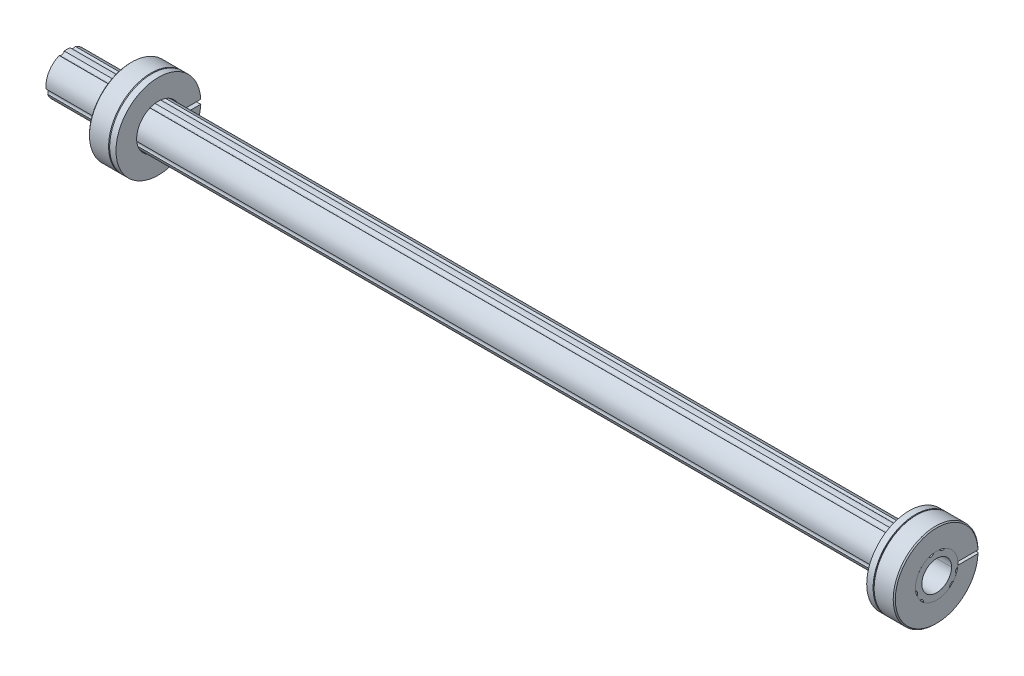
ISO-10303-21;
HEADER;
FILE_DESCRIPTION(('STEP AP214'),'2;1');
FILE_NAME('part.step','',(''),(''),'','','');
FILE_SCHEMA(('AUTOMOTIVE_DESIGN { 1 0 10303 214 1 1 1 1 }'));
ENDSEC;
DATA;
#1=APPLICATION_CONTEXT('core data for automotive mechanical design processes');
#2=APPLICATION_PROTOCOL_DEFINITION('international standard','automotive_design',2000,#1);
#3=PRODUCT_CONTEXT('',#1,'mechanical');
#4=PRODUCT('Part','Part','',(#3));
#5=PRODUCT_RELATED_PRODUCT_CATEGORY('part','',(#4));
#6=PRODUCT_DEFINITION_FORMATION('','',#4);
#7=PRODUCT_DEFINITION_CONTEXT('part definition',#1,'design');
#8=PRODUCT_DEFINITION('design','',#6,#7);
#9=PRODUCT_DEFINITION_SHAPE('','',#8);
#10=(LENGTH_UNIT() NAMED_UNIT(*) SI_UNIT(.MILLI.,.METRE.));
#11=(NAMED_UNIT(*) PLANE_ANGLE_UNIT() SI_UNIT($,.RADIAN.));
#12=(NAMED_UNIT(*) SI_UNIT($,.STERADIAN.) SOLID_ANGLE_UNIT());
#13=UNCERTAINTY_MEASURE_WITH_UNIT(LENGTH_MEASURE(1.E-05),#10,'distance_accuracy_value','');
#14=(GEOMETRIC_REPRESENTATION_CONTEXT(3) GLOBAL_UNCERTAINTY_ASSIGNED_CONTEXT((#13)) GLOBAL_UNIT_ASSIGNED_CONTEXT((#10,
#11,#12)) REPRESENTATION_CONTEXT('',''));
#15=CARTESIAN_POINT('',(0.,0.,0.));
#16=DIRECTION('',(0.,0.,1.));
#17=DIRECTION('',(1.,0.,0.));
#18=AXIS2_PLACEMENT_3D('',#15,#16,#17);
#19=CARTESIAN_POINT('',(410.,-2.8211275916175,-10.528591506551));
#20=DIRECTION('',(1.,0.,0.));
#21=DIRECTION('',(0.,-0.25881904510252,-0.965925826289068));
#22=AXIS2_PLACEMENT_3D('',#19,#20,#21);
#23=CYLINDRICAL_SURFACE('',#22,1.588);
#24=DIRECTION('',(1.,0.,0.));
#25=VECTOR('',#24,1.);
#26=CARTESIAN_POINT('',(410.,-3.25142052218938,-9.));
#27=LINE('',#26,#25);
#28=CARTESIAN_POINT('',(20.,-3.25142052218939,-9.));
#29=VERTEX_POINT('',#28);
#30=CARTESIAN_POINT('',(10.,-3.25142052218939,-9.));
#31=VERTEX_POINT('',#30);
#32=EDGE_CURVE('P0_E246',#29,#31,#27,.F.);
#33=ORIENTED_EDGE('',*,*,#32,.T.);
#34=CARTESIAN_POINT('',(10.,-2.8211275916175,-10.528591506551));
#35=DIRECTION('',(-1.,0.,0.));
#36=DIRECTION('',(0.,-1.,0.));
#37=AXIS2_PLACEMENT_3D('',#34,#35,#36);
#38=CIRCLE('',#37,1.588);
#39=CARTESIAN_POINT('',(10.,-3.77594799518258,-9.2597093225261));
#40=VERTEX_POINT('',#39);
#41=EDGE_CURVE('P0_E264',#31,#40,#38,.F.);
#42=ORIENTED_EDGE('',*,*,#41,.T.);
#43=DIRECTION('',(-1.,0.,0.));
#44=VECTOR('',#43,1.);
#45=CARTESIAN_POINT('',(205.,-3.77594799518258,-9.2597093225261));
#46=LINE('',#45,#44);
#47=CARTESIAN_POINT('',(0.,-3.77594799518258,-9.2597093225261));
#48=VERTEX_POINT('',#47);
#49=EDGE_CURVE('P0_E21',#40,#48,#46,.T.);
#50=ORIENTED_EDGE('',*,*,#49,.T.);
#51=CARTESIAN_POINT('',(0.,-2.8211275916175,-10.528591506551));
#52=DIRECTION('',(1.,0.,0.));
#53=DIRECTION('',(0.,0.,-1.));
#54=AXIS2_PLACEMENT_3D('',#51,#52,#53);
#55=CIRCLE('',#54,1.588);
#56=CARTESIAN_POINT('',(0.,-1.35978777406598,-9.90711750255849));
#57=VERTEX_POINT('',#56);
#58=EDGE_CURVE('P0_E461',#57,#48,#55,.T.);
#59=ORIENTED_EDGE('',*,*,#58,.F.);
#60=DIRECTION('',(-1.,0.,0.));
#61=VECTOR('',#60,1.);
#62=CARTESIAN_POINT('',(205.,-1.35978777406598,-9.90711750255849));
#63=LINE('',#62,#61);
#64=CARTESIAN_POINT('',(10.,-1.35978777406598,-9.90711750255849));
#65=VERTEX_POINT('',#64);
#66=EDGE_CURVE('P0_E454',#65,#57,#63,.T.);
#67=ORIENTED_EDGE('',*,*,#66,.F.);
#68=CARTESIAN_POINT('',(10.,-2.39083466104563,-9.));
#69=VERTEX_POINT('',#68);
#70=EDGE_CURVE('P0_E259',#65,#69,#38,.F.);
#71=ORIENTED_EDGE('',*,*,#70,.T.);
#72=DIRECTION('',(1.,0.,0.));
#73=VECTOR('',#72,1.);
#74=CARTESIAN_POINT('',(410.,-2.39083466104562,-9.));
#75=LINE('',#74,#73);
#76=CARTESIAN_POINT('',(20.,-2.39083466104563,-9.));
#77=VERTEX_POINT('',#76);
#78=EDGE_CURVE('P0_E242',#69,#77,#75,.T.);
#79=ORIENTED_EDGE('',*,*,#78,.T.);
#80=CARTESIAN_POINT('',(20.,-2.8211275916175,-10.528591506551));
#81=DIRECTION('',(1.,0.,0.));
#82=DIRECTION('',(0.,1.,0.));
#83=AXIS2_PLACEMENT_3D('',#80,#81,#82);
#84=CIRCLE('',#83,1.588);
#85=CARTESIAN_POINT('',(20.,-1.35978777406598,-9.90711750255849));
#86=VERTEX_POINT('',#85);
#87=EDGE_CURVE('P0_E250',#77,#86,#84,.F.);
#88=ORIENTED_EDGE('',*,*,#87,.T.);
#89=CARTESIAN_POINT('',(410.,-1.35978777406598,-9.90711750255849));
#90=VERTEX_POINT('',#89);
#91=EDGE_CURVE('P0_E457',#90,#86,#63,.T.);
#92=ORIENTED_EDGE('',*,*,#91,.F.);
#93=CARTESIAN_POINT('',(410.,-2.8211275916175,-10.528591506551));
#94=DIRECTION('',(1.,0.,0.));
#95=DIRECTION('',(0.,0.,-1.));
#96=AXIS2_PLACEMENT_3D('',#93,#94,#95);
#97=CIRCLE('',#96,1.588);
#98=CARTESIAN_POINT('',(410.,-3.77594799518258,-9.2597093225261));
#99=VERTEX_POINT('',#98);
#100=EDGE_CURVE('P0_E448',#90,#99,#97,.T.);
#101=ORIENTED_EDGE('',*,*,#100,.T.);
#102=CARTESIAN_POINT('',(20.,-3.77594799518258,-9.2597093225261));
#103=VERTEX_POINT('',#102);
#104=EDGE_CURVE('P0_E445',#99,#103,#46,.T.);
#105=ORIENTED_EDGE('',*,*,#104,.T.);
#106=EDGE_CURVE('P0_E255',#103,#29,#84,.F.);
#107=ORIENTED_EDGE('',*,*,#106,.T.);
#108=EDGE_LOOP('',(#33,#42,#50,#59,#67,#71,#79,#88,#92,#101,#105,#107));
#109=FACE_BOUND('',#108,.T.);
#110=ADVANCED_FACE('P0_F18',(#109),#23,.F.);
#111=CARTESIAN_POINT('',(410.,0.,0.));
#112=DIRECTION('',(-1.,0.,0.));
#113=DIRECTION('',(0.,0.499999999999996,0.866025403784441));
#114=AXIS2_PLACEMENT_3D('',#111,#112,#113);
#115=CYLINDRICAL_SURFACE('',#114,10.);
#116=CARTESIAN_POINT('',(10.,0.,0.));
#117=DIRECTION('',(-1.,0.,0.));
#118=DIRECTION('',(0.,-1.,0.));
#119=AXIS2_PLACEMENT_3D('',#116,#117,#118);
#120=CIRCLE('',#119,10.);
#121=CARTESIAN_POINT('',(10.,-4.35889894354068,-9.));
#122=VERTEX_POINT('',#121);
#123=EDGE_CURVE('P0_E263',#122,#40,#120,.F.);
#124=ORIENTED_EDGE('',*,*,#123,.F.);
#125=DIRECTION('',(-1.,0.,0.));
#126=VECTOR('',#125,1.);
#127=CARTESIAN_POINT('',(410.,-4.35889894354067,-9.));
#128=LINE('',#127,#126);
#129=CARTESIAN_POINT('',(20.,-4.35889894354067,-9.));
#130=VERTEX_POINT('',#129);
#131=EDGE_CURVE('P0_E239',#130,#122,#128,.T.);
#132=ORIENTED_EDGE('',*,*,#131,.F.);
#133=CARTESIAN_POINT('',(20.,0.,0.));
#134=DIRECTION('',(1.,0.,0.));
#135=DIRECTION('',(0.,1.,0.));
#136=AXIS2_PLACEMENT_3D('',#133,#134,#135);
#137=CIRCLE('',#136,10.);
#138=EDGE_CURVE('P0_E254',#103,#130,#137,.F.);
#139=ORIENTED_EDGE('',*,*,#138,.F.);
#140=ORIENTED_EDGE('',*,*,#104,.F.);
#141=CARTESIAN_POINT('',(410.,0.,0.));
#142=DIRECTION('',(1.,0.,0.));
#143=DIRECTION('',(0.,0.,-1.));
#144=AXIS2_PLACEMENT_3D('',#141,#142,#143);
#145=CIRCLE('',#144,10.);
#146=CARTESIAN_POINT('',(410.,-6.13116950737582,-7.89992154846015));
#147=VERTEX_POINT('',#146);
#148=EDGE_CURVE('P0_E426',#147,#99,#145,.T.);
#149=ORIENTED_EDGE('',*,*,#148,.F.);
#150=DIRECTION('',(-1.,0.,0.));
#151=VECTOR('',#150,1.);
#152=CARTESIAN_POINT('',(205.,-6.13116950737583,-7.89992154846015));
#153=LINE('',#152,#151);
#154=CARTESIAN_POINT('',(0.,-6.13116950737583,-7.89992154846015));
#155=VERTEX_POINT('',#154);
#156=EDGE_CURVE('P0_E438',#147,#155,#153,.T.);
#157=ORIENTED_EDGE('',*,*,#156,.T.);
#158=CARTESIAN_POINT('',(0.,0.,0.));
#159=DIRECTION('',(1.,0.,0.));
#160=DIRECTION('',(0.,0.,-1.));
#161=AXIS2_PLACEMENT_3D('',#158,#159,#160);
#162=CIRCLE('',#161,10.);
#163=EDGE_CURVE('P0_E432',#155,#48,#162,.T.);
#164=ORIENTED_EDGE('',*,*,#163,.T.);
#165=ORIENTED_EDGE('',*,*,#49,.F.);
#166=EDGE_LOOP('',(#124,#132,#139,#140,#149,#157,#164,#165));
#167=FACE_BOUND('',#166,.T.);
#168=ADVANCED_FACE('P0_F533',(#167),#115,.T.);
#169=CARTESIAN_POINT('',(410.,10.,0.));
#170=DIRECTION('',(-1.,0.,0.));
#171=DIRECTION('',(0.,0.,1.));
#172=AXIS2_PLACEMENT_3D('',#169,#170,#171);
#173=PLANE('',#172);
#174=CARTESIAN_POINT('',(410.,0.,0.));
#175=DIRECTION('',(1.,0.,0.));
#176=DIRECTION('',(0.,0.,-1.));
#177=AXIS2_PLACEMENT_3D('',#174,#175,#176);
#178=CIRCLE('',#177,7.);
#179=CARTESIAN_POINT('',(410.,0.,7.));
#180=VERTEX_POINT('',#179);
#181=CARTESIAN_POINT('',(410.,0.,-7.));
#182=VERTEX_POINT('',#181);
#183=EDGE_CURVE('P0_E210',#180,#182,#178,.T.);
#184=ORIENTED_EDGE('',*,*,#183,.F.);
#185=CARTESIAN_POINT('',(410.,0.,0.));
#186=DIRECTION('',(1.,0.,0.));
#187=DIRECTION('',(0.,0.,-1.));
#188=AXIS2_PLACEMENT_3D('',#185,#186,#187);
#189=CIRCLE('',#188,7.);
#190=EDGE_CURVE('P0_E39',#182,#180,#189,.T.);
#191=ORIENTED_EDGE('',*,*,#190,.F.);
#192=EDGE_LOOP('',(#184,#191));
#193=FACE_BOUND('',#192,.T.);
#194=CARTESIAN_POINT('',(410.,-7.7074639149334,7.7074639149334));
#195=DIRECTION('',(-1.,0.,0.));
#196=DIRECTION('',(0.,0.,1.));
#197=AXIS2_PLACEMENT_3D('',#194,#195,#196);
#198=CIRCLE('',#197,1.588);
#199=CARTESIAN_POINT('',(410.,-6.13116950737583,7.89992154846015));
#200=VERTEX_POINT('',#199);
#201=CARTESIAN_POINT('',(410.,-7.89992154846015,6.13116950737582));
#202=VERTEX_POINT('',#201);
#203=EDGE_CURVE('P0_E421',#200,#202,#198,.T.);
#204=ORIENTED_EDGE('',*,*,#203,.T.);
#205=CARTESIAN_POINT('',(410.,0.,0.));
#206=DIRECTION('',(1.,0.,0.));
#207=DIRECTION('',(0.,0.,-1.));
#208=AXIS2_PLACEMENT_3D('',#205,#206,#207);
#209=CIRCLE('',#208,10.);
#210=CARTESIAN_POINT('',(410.,-7.89992154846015,-6.13116950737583));
#211=VERTEX_POINT('',#210);
#212=EDGE_CURVE('P0_E416',#202,#211,#209,.T.);
#213=ORIENTED_EDGE('',*,*,#212,.T.);
#214=CARTESIAN_POINT('',(410.,-7.7074639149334,-7.7074639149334));
#215=DIRECTION('',(1.,0.,0.));
#216=DIRECTION('',(0.,0.,-1.));
#217=AXIS2_PLACEMENT_3D('',#214,#215,#216);
#218=CIRCLE('',#217,1.588);
#219=EDGE_CURVE('P0_E410',#147,#211,#218,.T.);
#220=ORIENTED_EDGE('',*,*,#219,.F.);
#221=ORIENTED_EDGE('',*,*,#148,.T.);
#222=ORIENTED_EDGE('',*,*,#100,.F.);
#223=CARTESIAN_POINT('',(410.,0.,0.));
#224=DIRECTION('',(1.,0.,0.));
#225=DIRECTION('',(0.,0.,-1.));
#226=AXIS2_PLACEMENT_3D('',#223,#224,#225);
#227=CIRCLE('',#226,10.);
#228=CARTESIAN_POINT('',(410.,9.2597093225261,-3.77594799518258));
#229=VERTEX_POINT('',#228);
#230=EDGE_CURVE('P0_E405',#90,#229,#227,.T.);
#231=ORIENTED_EDGE('',*,*,#230,.T.);
#232=CARTESIAN_POINT('',(410.,10.528591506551,-2.8211275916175));
#233=DIRECTION('',(1.,0.,0.));
#234=DIRECTION('',(0.,0.,-1.));
#235=AXIS2_PLACEMENT_3D('',#232,#233,#234);
#236=CIRCLE('',#235,1.588);
#237=CARTESIAN_POINT('',(410.,9.90711750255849,-1.35978777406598));
#238=VERTEX_POINT('',#237);
#239=EDGE_CURVE('P0_E399',#238,#229,#236,.T.);
#240=ORIENTED_EDGE('',*,*,#239,.F.);
#241=CARTESIAN_POINT('',(410.,0.,0.));
#242=DIRECTION('',(1.,0.,0.));
#243=DIRECTION('',(0.,0.,-1.));
#244=AXIS2_PLACEMENT_3D('',#241,#242,#243);
#245=CIRCLE('',#244,10.);
#246=CARTESIAN_POINT('',(410.,9.90711750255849,1.35978777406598));
#247=VERTEX_POINT('',#246);
#248=EDGE_CURVE('P0_E394',#238,#247,#245,.T.);
#249=ORIENTED_EDGE('',*,*,#248,.T.);
#250=CARTESIAN_POINT('',(410.,10.528591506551,2.8211275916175));
#251=DIRECTION('',(1.,0.,0.));
#252=DIRECTION('',(0.,0.,-1.));
#253=AXIS2_PLACEMENT_3D('',#250,#251,#252);
#254=CIRCLE('',#253,1.588);
#255=CARTESIAN_POINT('',(410.,9.25970932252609,3.77594799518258));
#256=VERTEX_POINT('',#255);
#257=EDGE_CURVE('P0_E388',#256,#247,#254,.T.);
#258=ORIENTED_EDGE('',*,*,#257,.F.);
#259=CARTESIAN_POINT('',(410.,0.,0.));
#260=DIRECTION('',(1.,0.,0.));
#261=DIRECTION('',(0.,0.,-1.));
#262=AXIS2_PLACEMENT_3D('',#259,#260,#261);
#263=CIRCLE('',#262,10.);
#264=CARTESIAN_POINT('',(410.,-1.35978777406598,9.90711750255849));
#265=VERTEX_POINT('',#264);
#266=EDGE_CURVE('P0_E383',#256,#265,#263,.T.);
#267=ORIENTED_EDGE('',*,*,#266,.T.);
#268=CARTESIAN_POINT('',(410.,-2.8211275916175,10.528591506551));
#269=DIRECTION('',(-1.,0.,0.));
#270=DIRECTION('',(0.,0.,1.));
#271=AXIS2_PLACEMENT_3D('',#268,#269,#270);
#272=CIRCLE('',#271,1.588);
#273=CARTESIAN_POINT('',(410.,-3.77594799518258,9.25970932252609));
#274=VERTEX_POINT('',#273);
#275=EDGE_CURVE('P0_E378',#265,#274,#272,.T.);
#276=ORIENTED_EDGE('',*,*,#275,.T.);
#277=CARTESIAN_POINT('',(410.,0.,0.));
#278=DIRECTION('',(1.,0.,0.));
#279=DIRECTION('',(0.,0.,-1.));
#280=AXIS2_PLACEMENT_3D('',#277,#278,#279);
#281=CIRCLE('',#280,10.);
#282=EDGE_CURVE('P0_E373',#274,#200,#281,.T.);
#283=ORIENTED_EDGE('',*,*,#282,.T.);
#284=EDGE_LOOP('',(#204,#213,#220,#221,#222,#231,#240,#249,#258,#267,#276,#283));
#285=FACE_BOUND('',#284,.T.);
#286=ADVANCED_FACE('P0_F489',(#193,#285),#173,.F.);
#287=CARTESIAN_POINT('',(410.,0.,0.));
#288=DIRECTION('',(-1.,0.,0.));
#289=DIRECTION('',(0.,0.499999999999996,-0.866025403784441));
#290=AXIS2_PLACEMENT_3D('',#287,#288,#289);
#291=CYLINDRICAL_SURFACE('',#290,10.);
#292=DIRECTION('',(-1.,0.,0.));
#293=VECTOR('',#292,1.);
#294=CARTESIAN_POINT('',(205.,-6.13116950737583,7.89992154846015));
#295=LINE('',#294,#293);
#296=CARTESIAN_POINT('',(0.,-6.13116950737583,7.89992154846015));
#297=VERTEX_POINT('',#296);
#298=EDGE_CURVE('P0_E367',#200,#297,#295,.T.);
#299=ORIENTED_EDGE('',*,*,#298,.F.);
#300=ORIENTED_EDGE('',*,*,#282,.F.);
#301=DIRECTION('',(-1.,0.,0.));
#302=VECTOR('',#301,1.);
#303=CARTESIAN_POINT('',(205.,-3.77594799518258,9.2597093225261));
#304=LINE('',#303,#302);
#305=CARTESIAN_POINT('',(0.,-3.77594799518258,9.2597093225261));
#306=VERTEX_POINT('',#305);
#307=EDGE_CURVE('P0_E362',#274,#306,#304,.T.);
#308=ORIENTED_EDGE('',*,*,#307,.T.);
#309=CARTESIAN_POINT('',(0.,0.,0.));
#310=DIRECTION('',(1.,0.,0.));
#311=DIRECTION('',(0.,0.,-1.));
#312=AXIS2_PLACEMENT_3D('',#309,#310,#311);
#313=CIRCLE('',#312,10.);
#314=EDGE_CURVE('P0_E357',#306,#297,#313,.T.);
#315=ORIENTED_EDGE('',*,*,#314,.T.);
#316=EDGE_LOOP('',(#299,#300,#308,#315));
#317=FACE_BOUND('',#316,.T.);
#318=ADVANCED_FACE('P0_F512',(#317),#291,.T.);
#319=CARTESIAN_POINT('',(0.,0.,0.));
#320=DIRECTION('',(1.,0.,0.));
#321=DIRECTION('',(0.,0.,-1.));
#322=AXIS2_PLACEMENT_3D('',#319,#320,#321);
#323=PLANE('',#322);
#324=CARTESIAN_POINT('',(0.,0.,0.));
#325=DIRECTION('',(1.,0.,0.));
#326=DIRECTION('',(0.,0.,-1.));
#327=AXIS2_PLACEMENT_3D('',#324,#325,#326);
#328=CIRCLE('',#327,7.);
#329=CARTESIAN_POINT('',(0.,0.,7.));
#330=VERTEX_POINT('',#329);
#331=CARTESIAN_POINT('',(0.,0.,-7.));
#332=VERTEX_POINT('',#331);
#333=EDGE_CURVE('P0_E203',#330,#332,#328,.T.);
#334=ORIENTED_EDGE('',*,*,#333,.T.);
#335=CARTESIAN_POINT('',(0.,0.,0.));
#336=DIRECTION('',(1.,0.,0.));
#337=DIRECTION('',(0.,0.,-1.));
#338=AXIS2_PLACEMENT_3D('',#335,#336,#337);
#339=CIRCLE('',#338,7.);
#340=EDGE_CURVE('P0_E46',#332,#330,#339,.T.);
#341=ORIENTED_EDGE('',*,*,#340,.T.);
#342=EDGE_LOOP('',(#334,#341));
#343=FACE_BOUND('',#342,.T.);
#344=CARTESIAN_POINT('',(0.,0.,0.));
#345=DIRECTION('',(1.,0.,0.));
#346=DIRECTION('',(0.,0.,-1.));
#347=AXIS2_PLACEMENT_3D('',#344,#345,#346);
#348=CIRCLE('',#347,10.);
#349=CARTESIAN_POINT('',(0.,9.90711750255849,-1.35978777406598));
#350=VERTEX_POINT('',#349);
#351=CARTESIAN_POINT('',(0.,9.90711750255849,1.35978777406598));
#352=VERTEX_POINT('',#351);
#353=EDGE_CURVE('P0_E351',#350,#352,#348,.T.);
#354=ORIENTED_EDGE('',*,*,#353,.F.);
#355=CARTESIAN_POINT('',(0.,10.528591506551,-2.8211275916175));
#356=DIRECTION('',(1.,0.,0.));
#357=DIRECTION('',(0.,0.,-1.));
#358=AXIS2_PLACEMENT_3D('',#355,#356,#357);
#359=CIRCLE('',#358,1.588);
#360=CARTESIAN_POINT('',(0.,9.2597093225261,-3.77594799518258));
#361=VERTEX_POINT('',#360);
#362=EDGE_CURVE('P0_E346',#350,#361,#359,.T.);
#363=ORIENTED_EDGE('',*,*,#362,.T.);
#364=CARTESIAN_POINT('',(0.,0.,0.));
#365=DIRECTION('',(1.,0.,0.));
#366=DIRECTION('',(0.,0.,-1.));
#367=AXIS2_PLACEMENT_3D('',#364,#365,#366);
#368=CIRCLE('',#367,10.);
#369=EDGE_CURVE('P0_E340',#57,#361,#368,.T.);
#370=ORIENTED_EDGE('',*,*,#369,.F.);
#371=ORIENTED_EDGE('',*,*,#58,.T.);
#372=ORIENTED_EDGE('',*,*,#163,.F.);
#373=CARTESIAN_POINT('',(0.,-7.7074639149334,-7.7074639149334));
#374=DIRECTION('',(1.,0.,0.));
#375=DIRECTION('',(0.,0.,-1.));
#376=AXIS2_PLACEMENT_3D('',#373,#374,#375);
#377=CIRCLE('',#376,1.588);
#378=CARTESIAN_POINT('',(0.,-7.89992154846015,-6.13116950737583));
#379=VERTEX_POINT('',#378);
#380=EDGE_CURVE('P0_E335',#155,#379,#377,.T.);
#381=ORIENTED_EDGE('',*,*,#380,.T.);
#382=CARTESIAN_POINT('',(0.,0.,0.));
#383=DIRECTION('',(1.,0.,0.));
#384=DIRECTION('',(0.,0.,-1.));
#385=AXIS2_PLACEMENT_3D('',#382,#383,#384);
#386=CIRCLE('',#385,10.);
#387=CARTESIAN_POINT('',(0.,-7.89992154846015,6.13116950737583));
#388=VERTEX_POINT('',#387);
#389=EDGE_CURVE('P0_E329',#388,#379,#386,.T.);
#390=ORIENTED_EDGE('',*,*,#389,.F.);
#391=CARTESIAN_POINT('',(0.,-7.7074639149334,7.7074639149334));
#392=DIRECTION('',(1.,0.,0.));
#393=DIRECTION('',(0.,0.,-1.));
#394=AXIS2_PLACEMENT_3D('',#391,#392,#393);
#395=CIRCLE('',#394,1.588);
#396=EDGE_CURVE('P0_E323',#388,#297,#395,.T.);
#397=ORIENTED_EDGE('',*,*,#396,.T.);
#398=ORIENTED_EDGE('',*,*,#314,.F.);
#399=CARTESIAN_POINT('',(0.,-2.8211275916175,10.528591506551));
#400=DIRECTION('',(1.,0.,0.));
#401=DIRECTION('',(0.,0.,-1.));
#402=AXIS2_PLACEMENT_3D('',#399,#400,#401);
#403=CIRCLE('',#402,1.588);
#404=CARTESIAN_POINT('',(0.,-1.35978777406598,9.90711750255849));
#405=VERTEX_POINT('',#404);
#406=EDGE_CURVE('P0_E318',#306,#405,#403,.T.);
#407=ORIENTED_EDGE('',*,*,#406,.T.);
#408=CARTESIAN_POINT('',(0.,0.,0.));
#409=DIRECTION('',(1.,0.,0.));
#410=DIRECTION('',(0.,0.,-1.));
#411=AXIS2_PLACEMENT_3D('',#408,#409,#410);
#412=CIRCLE('',#411,10.);
#413=CARTESIAN_POINT('',(0.,9.25970932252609,3.77594799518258));
#414=VERTEX_POINT('',#413);
#415=EDGE_CURVE('P0_E312',#414,#405,#412,.T.);
#416=ORIENTED_EDGE('',*,*,#415,.F.);
#417=CARTESIAN_POINT('',(0.,10.528591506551,2.8211275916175));
#418=DIRECTION('',(1.,0.,0.));
#419=DIRECTION('',(0.,0.,-1.));
#420=AXIS2_PLACEMENT_3D('',#417,#418,#419);
#421=CIRCLE('',#420,1.588);
#422=EDGE_CURVE('P0_E307',#414,#352,#421,.T.);
#423=ORIENTED_EDGE('',*,*,#422,.T.);
#424=EDGE_LOOP('',(#354,#363,#370,#371,#372,#381,#390,#397,#398,#407,#416,#423));
#425=FACE_BOUND('',#424,.T.);
#426=ADVANCED_FACE('P0_F215',(#343,#425),#323,.F.);
#427=CARTESIAN_POINT('',(410.,10.528591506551,2.8211275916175));
#428=DIRECTION('',(1.,0.,0.));
#429=DIRECTION('',(0.,0.965925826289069,0.258819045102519));
#430=AXIS2_PLACEMENT_3D('',#427,#428,#429);
#431=CYLINDRICAL_SURFACE('',#430,1.588);
#432=ORIENTED_EDGE('',*,*,#422,.F.);
#433=DIRECTION('',(-1.,0.,0.));
#434=VECTOR('',#433,1.);
#435=CARTESIAN_POINT('',(205.,9.2597093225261,3.77594799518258));
#436=LINE('',#435,#434);
#437=EDGE_CURVE('P0_E301',#256,#414,#436,.T.);
#438=ORIENTED_EDGE('',*,*,#437,.F.);
#439=ORIENTED_EDGE('',*,*,#257,.T.);
#440=DIRECTION('',(-1.,0.,0.));
#441=VECTOR('',#440,1.);
#442=CARTESIAN_POINT('',(205.,9.90711750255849,1.35978777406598));
#443=LINE('',#442,#441);
#444=EDGE_CURVE('P0_E295',#247,#352,#443,.T.);
#445=ORIENTED_EDGE('',*,*,#444,.T.);
#446=EDGE_LOOP('',(#432,#438,#439,#445));
#447=FACE_BOUND('',#446,.T.);
#448=ADVANCED_FACE('P0_F501',(#447),#431,.F.);
#449=CARTESIAN_POINT('',(410.,0.,0.));
#450=DIRECTION('',(-1.,0.,0.));
#451=DIRECTION('',(0.,-1.,0.));
#452=AXIS2_PLACEMENT_3D('',#449,#450,#451);
#453=CYLINDRICAL_SURFACE('',#452,10.);
#454=ORIENTED_EDGE('',*,*,#444,.F.);
#455=ORIENTED_EDGE('',*,*,#248,.F.);
#456=DIRECTION('',(-1.,0.,0.));
#457=VECTOR('',#456,1.);
#458=CARTESIAN_POINT('',(205.,9.90711750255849,-1.35978777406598));
#459=LINE('',#458,#457);
#460=EDGE_CURVE('P0_E289',#238,#350,#459,.T.);
#461=ORIENTED_EDGE('',*,*,#460,.T.);
#462=ORIENTED_EDGE('',*,*,#353,.T.);
#463=EDGE_LOOP('',(#454,#455,#461,#462));
#464=FACE_BOUND('',#463,.T.);
#465=ADVANCED_FACE('P0_F497',(#464),#453,.T.);
#466=CARTESIAN_POINT('',(410.,10.528591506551,-2.8211275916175));
#467=DIRECTION('',(1.,0.,0.));
#468=DIRECTION('',(0.,0.965925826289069,-0.25881904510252));
#469=AXIS2_PLACEMENT_3D('',#466,#467,#468);
#470=CYLINDRICAL_SURFACE('',#469,1.588);
#471=ORIENTED_EDGE('',*,*,#362,.F.);
#472=ORIENTED_EDGE('',*,*,#460,.F.);
#473=ORIENTED_EDGE('',*,*,#239,.T.);
#474=DIRECTION('',(-1.,0.,0.));
#475=VECTOR('',#474,1.);
#476=CARTESIAN_POINT('',(205.,9.2597093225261,-3.77594799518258));
#477=LINE('',#476,#475);
#478=EDGE_CURVE('P0_E283',#229,#361,#477,.T.);
#479=ORIENTED_EDGE('',*,*,#478,.T.);
#480=EDGE_LOOP('',(#471,#472,#473,#479));
#481=FACE_BOUND('',#480,.T.);
#482=ADVANCED_FACE('P0_F494',(#481),#470,.F.);
#483=CARTESIAN_POINT('',(410.,0.,0.));
#484=DIRECTION('',(-1.,0.,0.));
#485=DIRECTION('',(0.,-0.500000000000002,0.866025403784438));
#486=AXIS2_PLACEMENT_3D('',#483,#484,#485);
#487=CYLINDRICAL_SURFACE('',#486,10.);
#488=CARTESIAN_POINT('',(10.,0.,0.));
#489=DIRECTION('',(-1.,0.,0.));
#490=DIRECTION('',(0.,-1.,0.));
#491=AXIS2_PLACEMENT_3D('',#488,#489,#490);
#492=CIRCLE('',#491,10.);
#493=CARTESIAN_POINT('',(9.99999999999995,4.35889894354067,-9.));
#494=VERTEX_POINT('',#493);
#495=EDGE_CURVE('P0_E11',#65,#494,#492,.F.);
#496=ORIENTED_EDGE('',*,*,#495,.F.);
#497=ORIENTED_EDGE('',*,*,#66,.T.);
#498=ORIENTED_EDGE('',*,*,#369,.T.);
#499=ORIENTED_EDGE('',*,*,#478,.F.);
#500=ORIENTED_EDGE('',*,*,#230,.F.);
#501=ORIENTED_EDGE('',*,*,#91,.T.);
#502=CARTESIAN_POINT('',(20.,0.,0.));
#503=DIRECTION('',(1.,0.,0.));
#504=DIRECTION('',(0.,1.,0.));
#505=AXIS2_PLACEMENT_3D('',#502,#503,#504);
#506=CIRCLE('',#505,10.);
#507=CARTESIAN_POINT('',(20.,4.35889894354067,-9.));
#508=VERTEX_POINT('',#507);
#509=EDGE_CURVE('P0_E28',#508,#86,#506,.F.);
#510=ORIENTED_EDGE('',*,*,#509,.F.);
#511=DIRECTION('',(-1.,0.,0.));
#512=VECTOR('',#511,1.);
#513=CARTESIAN_POINT('',(410.,4.35889894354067,-9.));
#514=LINE('',#513,#512);
#515=EDGE_CURVE('P0_E470',#494,#508,#514,.F.);
#516=ORIENTED_EDGE('',*,*,#515,.F.);
#517=EDGE_LOOP('',(#496,#497,#498,#499,#500,#501,#510,#516));
#518=FACE_BOUND('',#517,.T.);
#519=ADVANCED_FACE('P0_F486',(#518),#487,.T.);
#520=CARTESIAN_POINT('',(410.,0.,0.));
#521=DIRECTION('',(-1.,0.,0.));
#522=DIRECTION('',(0.,-0.500000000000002,-0.866025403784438));
#523=AXIS2_PLACEMENT_3D('',#520,#521,#522);
#524=CYLINDRICAL_SURFACE('',#523,10.);
#525=DIRECTION('',(-1.,0.,0.));
#526=VECTOR('',#525,1.);
#527=CARTESIAN_POINT('',(205.,-1.35978777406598,9.90711750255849));
#528=LINE('',#527,#526);
#529=EDGE_CURVE('P0_E277',#265,#405,#528,.T.);
#530=ORIENTED_EDGE('',*,*,#529,.F.);
#531=ORIENTED_EDGE('',*,*,#266,.F.);
#532=ORIENTED_EDGE('',*,*,#437,.T.);
#533=ORIENTED_EDGE('',*,*,#415,.T.);
#534=EDGE_LOOP('',(#530,#531,#532,#533));
#535=FACE_BOUND('',#534,.T.);
#536=ADVANCED_FACE('P0_F505',(#535),#524,.T.);
#537=CARTESIAN_POINT('',(410.,-2.8211275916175,10.528591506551));
#538=DIRECTION('',(1.,0.,0.));
#539=DIRECTION('',(0.,-0.258819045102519,0.965925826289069));
#540=AXIS2_PLACEMENT_3D('',#537,#538,#539);
#541=CYLINDRICAL_SURFACE('',#540,1.588);
#542=ORIENTED_EDGE('',*,*,#406,.F.);
#543=ORIENTED_EDGE('',*,*,#307,.F.);
#544=ORIENTED_EDGE('',*,*,#275,.F.);
#545=ORIENTED_EDGE('',*,*,#529,.T.);
#546=EDGE_LOOP('',(#542,#543,#544,#545));
#547=FACE_BOUND('',#546,.T.);
#548=ADVANCED_FACE('P0_F516',(#547),#541,.F.);
#549=CARTESIAN_POINT('',(410.,-7.7074639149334,7.7074639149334));
#550=DIRECTION('',(1.,0.,0.));
#551=DIRECTION('',(0.,-0.707106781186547,0.707106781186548));
#552=AXIS2_PLACEMENT_3D('',#549,#550,#551);
#553=CYLINDRICAL_SURFACE('',#552,1.588);
#554=ORIENTED_EDGE('',*,*,#396,.F.);
#555=DIRECTION('',(-1.,0.,0.));
#556=VECTOR('',#555,1.);
#557=CARTESIAN_POINT('',(205.,-7.89992154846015,6.13116950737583));
#558=LINE('',#557,#556);
#559=EDGE_CURVE('P0_E271',#202,#388,#558,.T.);
#560=ORIENTED_EDGE('',*,*,#559,.F.);
#561=ORIENTED_EDGE('',*,*,#203,.F.);
#562=ORIENTED_EDGE('',*,*,#298,.T.);
#563=EDGE_LOOP('',(#554,#560,#561,#562));
#564=FACE_BOUND('',#563,.T.);
#565=ADVANCED_FACE('P0_F520',(#564),#553,.F.);
#566=CARTESIAN_POINT('',(410.,0.,0.));
#567=DIRECTION('',(-1.,0.,0.));
#568=DIRECTION('',(0.,1.,0.));
#569=AXIS2_PLACEMENT_3D('',#566,#567,#568);
#570=CYLINDRICAL_SURFACE('',#569,10.);
#571=ORIENTED_EDGE('',*,*,#559,.T.);
#572=ORIENTED_EDGE('',*,*,#389,.T.);
#573=DIRECTION('',(-1.,0.,0.));
#574=VECTOR('',#573,1.);
#575=CARTESIAN_POINT('',(205.,-7.89992154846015,-6.13116950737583));
#576=LINE('',#575,#574);
#577=EDGE_CURVE('P0_E267',#211,#379,#576,.T.);
#578=ORIENTED_EDGE('',*,*,#577,.F.);
#579=ORIENTED_EDGE('',*,*,#212,.F.);
#580=EDGE_LOOP('',(#571,#572,#578,#579));
#581=FACE_BOUND('',#580,.T.);
#582=ADVANCED_FACE('P0_F526',(#581),#570,.T.);
#583=CARTESIAN_POINT('',(410.,-7.7074639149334,-7.7074639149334));
#584=DIRECTION('',(1.,0.,0.));
#585=DIRECTION('',(0.,-0.707106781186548,-0.707106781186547));
#586=AXIS2_PLACEMENT_3D('',#583,#584,#585);
#587=CYLINDRICAL_SURFACE('',#586,1.588);
#588=ORIENTED_EDGE('',*,*,#380,.F.);
#589=ORIENTED_EDGE('',*,*,#156,.F.);
#590=ORIENTED_EDGE('',*,*,#219,.T.);
#591=ORIENTED_EDGE('',*,*,#577,.T.);
#592=EDGE_LOOP('',(#588,#589,#590,#591));
#593=FACE_BOUND('',#592,.T.);
#594=ADVANCED_FACE('P0_F529',(#593),#587,.F.);
#595=CARTESIAN_POINT('',(10.,25.7324547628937,-9.));
#596=DIRECTION('',(0.,0.,1.));
#597=DIRECTION('',(1.,0.,0.));
#598=AXIS2_PLACEMENT_3D('',#595,#596,#597);
#599=PLANE('',#598);
#600=DIRECTION('',(0.,-1.,0.));
#601=VECTOR('',#600,1.);
#602=CARTESIAN_POINT('',(10.,-25.7324547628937,-9.));
#603=LINE('',#602,#601);
#604=EDGE_CURVE('P0_E225',#494,#69,#603,.T.);
#605=ORIENTED_EDGE('',*,*,#604,.F.);
#606=ORIENTED_EDGE('',*,*,#515,.T.);
#607=DIRECTION('',(0.,1.,0.));
#608=VECTOR('',#607,1.);
#609=CARTESIAN_POINT('',(20.,-25.7324547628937,-9.));
#610=LINE('',#609,#608);
#611=EDGE_CURVE('P0_E234',#77,#508,#610,.T.);
#612=ORIENTED_EDGE('',*,*,#611,.F.);
#613=ORIENTED_EDGE('',*,*,#78,.F.);
#614=EDGE_LOOP('',(#605,#606,#612,#613));
#615=FACE_BOUND('',#614,.T.);
#616=ADVANCED_FACE('P0_F782',(#615),#599,.F.);
#617=CARTESIAN_POINT('',(20.,-25.7324547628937,-10.000025));
#618=DIRECTION('',(1.,0.,0.));
#619=DIRECTION('',(0.,1.,0.));
#620=AXIS2_PLACEMENT_3D('',#617,#618,#619);
#621=PLANE('',#620);
#622=ORIENTED_EDGE('',*,*,#611,.T.);
#623=ORIENTED_EDGE('',*,*,#509,.T.);
#624=ORIENTED_EDGE('',*,*,#87,.F.);
#625=EDGE_LOOP('',(#622,#623,#624));
#626=FACE_BOUND('',#625,.T.);
#627=ADVANCED_FACE('P0_F478',(#626),#621,.F.);
#628=CARTESIAN_POINT('',(10.,-25.7324547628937,-10.000025));
#629=DIRECTION('',(-1.,0.,0.));
#630=DIRECTION('',(0.,-1.,0.));
#631=AXIS2_PLACEMENT_3D('',#628,#629,#630);
#632=PLANE('',#631);
#633=ORIENTED_EDGE('',*,*,#495,.T.);
#634=ORIENTED_EDGE('',*,*,#604,.T.);
#635=ORIENTED_EDGE('',*,*,#70,.F.);
#636=EDGE_LOOP('',(#633,#634,#635));
#637=FACE_BOUND('',#636,.T.);
#638=ADVANCED_FACE('P0_F801',(#637),#632,.F.);
#639=EDGE_CURVE('P0_E218',#31,#122,#603,.T.);
#640=ORIENTED_EDGE('',*,*,#639,.T.);
#641=ORIENTED_EDGE('',*,*,#123,.T.);
#642=ORIENTED_EDGE('',*,*,#41,.F.);
#643=EDGE_LOOP('',(#640,#641,#642));
#644=FACE_BOUND('',#643,.T.);
#645=ADVANCED_FACE('P0_F812',(#644),#632,.F.);
#646=ORIENTED_EDGE('',*,*,#138,.T.);
#647=EDGE_CURVE('P0_E238',#130,#29,#610,.T.);
#648=ORIENTED_EDGE('',*,*,#647,.T.);
#649=ORIENTED_EDGE('',*,*,#106,.F.);
#650=EDGE_LOOP('',(#646,#648,#649));
#651=FACE_BOUND('',#650,.T.);
#652=ADVANCED_FACE('P0_F803',(#651),#621,.F.);
#653=ORIENTED_EDGE('',*,*,#647,.F.);
#654=ORIENTED_EDGE('',*,*,#131,.T.);
#655=ORIENTED_EDGE('',*,*,#639,.F.);
#656=ORIENTED_EDGE('',*,*,#32,.F.);
#657=EDGE_LOOP('',(#653,#654,#655,#656));
#658=FACE_BOUND('',#657,.T.);
#659=ADVANCED_FACE('P0_F792',(#658),#599,.F.);
#660=CARTESIAN_POINT('',(410.,0.,0.));
#661=DIRECTION('',(-1.,0.,0.));
#662=DIRECTION('',(0.,-1.,0.));
#663=AXIS2_PLACEMENT_3D('',#660,#661,#662);
#664=CYLINDRICAL_SURFACE('',#663,7.);
#665=ORIENTED_EDGE('',*,*,#190,.T.);
#666=DIRECTION('',(-1.,0.,0.));
#667=VECTOR('',#666,1.);
#668=CARTESIAN_POINT('',(410.,0.,7.));
#669=LINE('',#668,#667);
#670=EDGE_CURVE('P0_E205',#180,#330,#669,.T.);
#671=ORIENTED_EDGE('',*,*,#670,.T.);
#672=ORIENTED_EDGE('',*,*,#340,.F.);
#673=DIRECTION('',(-1.,0.,0.));
#674=VECTOR('',#673,1.);
#675=CARTESIAN_POINT('',(410.,0.,-7.));
#676=LINE('',#675,#674);
#677=EDGE_CURVE('P0_E207',#182,#332,#676,.T.);
#678=ORIENTED_EDGE('',*,*,#677,.F.);
#679=EDGE_LOOP('',(#665,#671,#672,#678));
#680=FACE_BOUND('',#679,.T.);
#681=ADVANCED_FACE('P0_F212',(#680),#664,.F.);
#682=CARTESIAN_POINT('',(410.,0.,0.));
#683=DIRECTION('',(-1.,0.,0.));
#684=DIRECTION('',(0.,1.,0.));
#685=AXIS2_PLACEMENT_3D('',#682,#683,#684);
#686=CYLINDRICAL_SURFACE('',#685,7.);
#687=ORIENTED_EDGE('',*,*,#333,.F.);
#688=ORIENTED_EDGE('',*,*,#670,.F.);
#689=ORIENTED_EDGE('',*,*,#183,.T.);
#690=ORIENTED_EDGE('',*,*,#677,.T.);
#691=EDGE_LOOP('',(#687,#688,#689,#690));
#692=FACE_BOUND('',#691,.T.);
#693=ADVANCED_FACE('P0_F204',(#692),#686,.F.);
#694=CLOSED_SHELL('',(#110,#168,#286,#318,#426,#448,#465,#482,#519,#536,#548,#565,#582,#594,
#616,#627,#638,#645,#652,#659,#681,#693));
#695=MANIFOLD_SOLID_BREP('P0_B1',#694);
#696=CARTESIAN_POINT('',(400.,0.750000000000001,-9.97183533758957));
#697=DIRECTION('',(0.,1.,0.));
#698=DIRECTION('',(0.,0.,-1.));
#699=AXIS2_PLACEMENT_3D('',#696,#697,#698);
#700=PLANE('',#699);
#701=DIRECTION('',(1.,0.,0.));
#702=VECTOR('',#701,1.);
#703=CARTESIAN_POINT('',(400.,0.749999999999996,-19.9859325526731));
#704=LINE('',#703,#702);
#705=CARTESIAN_POINT('',(400.5,0.749999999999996,-19.9859325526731));
#706=VERTEX_POINT('',#705);
#707=CARTESIAN_POINT('',(409.5,0.749999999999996,-19.9859325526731));
#708=VERTEX_POINT('',#707);
#709=EDGE_CURVE('P1_E124',#706,#708,#704,.T.);
#710=ORIENTED_EDGE('',*,*,#709,.T.);
#711=CARTESIAN_POINT('',(409.5,0.749999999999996,-19.9859325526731));
#712=CARTESIAN_POINT('',(409.583334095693,0.749999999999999,-19.9025398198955));
#713=CARTESIAN_POINT('',(409.666667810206,0.750000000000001,-19.8191467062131));
#714=CARTESIAN_POINT('',(409.833334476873,0.750000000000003,-19.6523597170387));
#715=CARTESIAN_POINT('',(409.916667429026,0.750000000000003,-19.5689658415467));
#716=CARTESIAN_POINT('',(410.,0.750000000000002,-19.4855715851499));
#717=B_SPLINE_CURVE_WITH_KNOTS('',3,(#711,#712,#713,#714,#715,#716),.UNSPECIFIED.,.F.,.F.,(4,2,
4),(0.,0.353681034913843,0.707362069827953),.UNSPECIFIED.);
#718=CARTESIAN_POINT('',(410.,0.750000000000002,-19.4855715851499));
#719=VERTEX_POINT('',#718);
#720=EDGE_CURVE('P1_E138',#708,#719,#717,.T.);
#721=ORIENTED_EDGE('',*,*,#720,.T.);
#722=DIRECTION('',(0.,0.,1.));
#723=VECTOR('',#722,1.);
#724=CARTESIAN_POINT('',(410.,0.750000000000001,-9.97183533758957));
#725=LINE('',#724,#723);
#726=CARTESIAN_POINT('',(410.,0.750000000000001,-9.97183533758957));
#727=VERTEX_POINT('',#726);
#728=EDGE_CURVE('P1_E108',#719,#727,#725,.T.);
#729=ORIENTED_EDGE('',*,*,#728,.T.);
#730=DIRECTION('',(1.,0.,0.));
#731=VECTOR('',#730,1.);
#732=CARTESIAN_POINT('',(400.,0.750000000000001,-9.97183533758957));
#733=LINE('',#732,#731);
#734=CARTESIAN_POINT('',(400.,0.750000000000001,-9.97183533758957));
#735=VERTEX_POINT('',#734);
#736=EDGE_CURVE('P1_E197',#735,#727,#733,.T.);
#737=ORIENTED_EDGE('',*,*,#736,.F.);
#738=DIRECTION('',(0.,0.,1.));
#739=VECTOR('',#738,1.);
#740=CARTESIAN_POINT('',(400.,0.750000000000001,-9.97183533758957));
#741=LINE('',#740,#739);
#742=CARTESIAN_POINT('',(400.,0.750000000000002,-19.4855715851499));
#743=VERTEX_POINT('',#742);
#744=EDGE_CURVE('P1_E98',#743,#735,#741,.T.);
#745=ORIENTED_EDGE('',*,*,#744,.F.);
#746=CARTESIAN_POINT('',(400.,0.750000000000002,-19.4855715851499));
#747=CARTESIAN_POINT('',(400.083332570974,0.750000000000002,-19.5689658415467));
#748=CARTESIAN_POINT('',(400.166665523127,0.750000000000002,-19.6523597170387));
#749=CARTESIAN_POINT('',(400.333332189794,0.750000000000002,-19.8191467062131));
#750=CARTESIAN_POINT('',(400.416665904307,0.750000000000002,-19.9025398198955));
#751=CARTESIAN_POINT('',(400.5,0.750000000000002,-19.9859325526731));
#752=B_SPLINE_CURVE_WITH_KNOTS('',3,(#746,#747,#748,#749,#750,#751),.UNSPECIFIED.,.F.,.F.,(4,2,
4),(0.,0.353681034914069,0.707362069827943),.UNSPECIFIED.);
#753=EDGE_CURVE('P1_E131',#743,#706,#752,.T.);
#754=ORIENTED_EDGE('',*,*,#753,.T.);
#755=EDGE_LOOP('',(#710,#721,#729,#737,#745,#754));
#756=FACE_BOUND('',#755,.T.);
#757=ADVANCED_FACE('P1_F17',(#756),#700,.F.);
#758=CARTESIAN_POINT('',(400.,0.,0.));
#759=DIRECTION('',(1.,0.,0.));
#760=DIRECTION('',(0.,-1.,0.));
#761=AXIS2_PLACEMENT_3D('',#758,#759,#760);
#762=CYLINDRICAL_SURFACE('',#761,10.);
#763=CARTESIAN_POINT('',(410.,0.,0.));
#764=DIRECTION('',(1.,0.,0.));
#765=DIRECTION('',(0.,1.,0.));
#766=AXIS2_PLACEMENT_3D('',#763,#764,#765);
#767=CIRCLE('',#766,10.);
#768=CARTESIAN_POINT('',(410.,-0.75,-9.97183533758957));
#769=VERTEX_POINT('',#768);
#770=EDGE_CURVE('P1_E112',#727,#769,#767,.T.);
#771=ORIENTED_EDGE('',*,*,#770,.T.);
#772=DIRECTION('',(1.,0.,0.));
#773=VECTOR('',#772,1.);
#774=CARTESIAN_POINT('',(400.,-0.75,-9.97183533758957));
#775=LINE('',#774,#773);
#776=CARTESIAN_POINT('',(400.,-0.75,-9.97183533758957));
#777=VERTEX_POINT('',#776);
#778=EDGE_CURVE('P1_E93',#777,#769,#775,.T.);
#779=ORIENTED_EDGE('',*,*,#778,.F.);
#780=CARTESIAN_POINT('',(400.,0.,0.));
#781=DIRECTION('',(1.,0.,0.));
#782=DIRECTION('',(0.,1.,0.));
#783=AXIS2_PLACEMENT_3D('',#780,#781,#782);
#784=CIRCLE('',#783,10.);
#785=EDGE_CURVE('P1_E99',#735,#777,#784,.T.);
#786=ORIENTED_EDGE('',*,*,#785,.F.);
#787=ORIENTED_EDGE('',*,*,#736,.T.);
#788=EDGE_LOOP('',(#771,#779,#786,#787));
#789=FACE_BOUND('',#788,.T.);
#790=ADVANCED_FACE('P1_F110',(#789),#762,.F.);
#791=CARTESIAN_POINT('',(400.,-0.75,-9.97183533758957));
#792=DIRECTION('',(0.,-1.,0.));
#793=DIRECTION('',(0.,0.,1.));
#794=AXIS2_PLACEMENT_3D('',#791,#792,#793);
#795=PLANE('',#794);
#796=DIRECTION('',(0.,0.,-1.));
#797=VECTOR('',#796,1.);
#798=CARTESIAN_POINT('',(410.,-0.75,-9.97183533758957));
#799=LINE('',#798,#797);
#800=CARTESIAN_POINT('',(410.,-0.749999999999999,-19.4855715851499));
#801=VERTEX_POINT('',#800);
#802=EDGE_CURVE('P1_E180',#769,#801,#799,.T.);
#803=ORIENTED_EDGE('',*,*,#802,.T.);
#804=CARTESIAN_POINT('',(410.,-0.749999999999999,-19.4855715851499));
#805=CARTESIAN_POINT('',(409.916667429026,-0.749999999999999,-19.5689658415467));
#806=CARTESIAN_POINT('',(409.833334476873,-0.749999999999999,-19.6523597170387));
#807=CARTESIAN_POINT('',(409.666667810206,-0.749999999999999,-19.8191467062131));
#808=CARTESIAN_POINT('',(409.583334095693,-0.749999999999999,-19.9025398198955));
#809=CARTESIAN_POINT('',(409.5,-0.749999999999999,-19.9859325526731));
#810=B_SPLINE_CURVE_WITH_KNOTS('',3,(#804,#805,#806,#807,#808,#809),.UNSPECIFIED.,.F.,.F.,(4,2,
4),(0.,0.353681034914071,0.70736206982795),.UNSPECIFIED.);
#811=CARTESIAN_POINT('',(409.5,-0.749999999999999,-19.9859325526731));
#812=VERTEX_POINT('',#811);
#813=EDGE_CURVE('P1_E27',#801,#812,#810,.T.);
#814=ORIENTED_EDGE('',*,*,#813,.T.);
#815=DIRECTION('',(1.,0.,0.));
#816=VECTOR('',#815,1.);
#817=CARTESIAN_POINT('',(400.,-0.749999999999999,-19.9859325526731));
#818=LINE('',#817,#816);
#819=CARTESIAN_POINT('',(400.5,-0.749999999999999,-19.9859325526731));
#820=VERTEX_POINT('',#819);
#821=EDGE_CURVE('P1_E115',#820,#812,#818,.T.);
#822=ORIENTED_EDGE('',*,*,#821,.F.);
#823=CARTESIAN_POINT('',(400.5,-0.749999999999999,-19.9859325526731));
#824=CARTESIAN_POINT('',(400.416665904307,-0.749999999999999,-19.9025398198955));
#825=CARTESIAN_POINT('',(400.333332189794,-0.749999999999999,-19.8191467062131));
#826=CARTESIAN_POINT('',(400.166665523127,-0.749999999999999,-19.6523597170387));
#827=CARTESIAN_POINT('',(400.083332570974,-0.749999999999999,-19.5689658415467));
#828=CARTESIAN_POINT('',(400.,-0.749999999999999,-19.4855715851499));
#829=B_SPLINE_CURVE_WITH_KNOTS('',3,(#823,#824,#825,#826,#827,#828),.UNSPECIFIED.,.F.,.F.,(4,2,
4),(0.,0.353681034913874,0.707362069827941),.UNSPECIFIED.);
#830=CARTESIAN_POINT('',(400.,-0.749999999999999,-19.4855715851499));
#831=VERTEX_POINT('',#830);
#832=EDGE_CURVE('P1_E39',#820,#831,#829,.T.);
#833=ORIENTED_EDGE('',*,*,#832,.T.);
#834=DIRECTION('',(0.,0.,-1.));
#835=VECTOR('',#834,1.);
#836=CARTESIAN_POINT('',(400.,-0.75,-9.97183533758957));
#837=LINE('',#836,#835);
#838=EDGE_CURVE('P1_E89',#777,#831,#837,.T.);
#839=ORIENTED_EDGE('',*,*,#838,.F.);
#840=ORIENTED_EDGE('',*,*,#778,.T.);
#841=EDGE_LOOP('',(#803,#814,#822,#833,#839,#840));
#842=FACE_BOUND('',#841,.T.);
#843=ADVANCED_FACE('P1_F91',(#842),#795,.F.);
#844=CARTESIAN_POINT('',(400.,0.,0.));
#845=DIRECTION('',(1.,0.,0.));
#846=DIRECTION('',(0.,-1.,0.));
#847=AXIS2_PLACEMENT_3D('',#844,#845,#846);
#848=CYLINDRICAL_SURFACE('',#847,20.);
#849=ORIENTED_EDGE('',*,*,#821,.T.);
#850=CARTESIAN_POINT('',(409.5,0.,0.));
#851=DIRECTION('',(-1.,0.,0.));
#852=DIRECTION('',(0.,1.,0.));
#853=AXIS2_PLACEMENT_3D('',#850,#851,#852);
#854=CIRCLE('',#853,20.);
#855=EDGE_CURVE('P1_E121',#812,#708,#854,.T.);
#856=ORIENTED_EDGE('',*,*,#855,.T.);
#857=ORIENTED_EDGE('',*,*,#709,.F.);
#858=CARTESIAN_POINT('',(400.5,0.,0.));
#859=DIRECTION('',(-1.,0.,0.));
#860=DIRECTION('',(0.,1.,0.));
#861=AXIS2_PLACEMENT_3D('',#858,#859,#860);
#862=CIRCLE('',#861,20.);
#863=EDGE_CURVE('P1_E114',#706,#820,#862,.F.);
#864=ORIENTED_EDGE('',*,*,#863,.T.);
#865=EDGE_LOOP('',(#849,#856,#857,#864));
#866=FACE_BOUND('',#865,.T.);
#867=ADVANCED_FACE('P1_F150',(#866),#848,.T.);
#868=CARTESIAN_POINT('',(400.,0.,0.));
#869=DIRECTION('',(-1.,0.,0.));
#870=DIRECTION('',(0.,1.,0.));
#871=AXIS2_PLACEMENT_3D('',#868,#869,#870);
#872=PLANE('',#871);
#873=ORIENTED_EDGE('',*,*,#838,.T.);
#874=CARTESIAN_POINT('',(400.,0.,0.));
#875=DIRECTION('',(-1.,0.,0.));
#876=DIRECTION('',(0.,1.,0.));
#877=AXIS2_PLACEMENT_3D('',#874,#875,#876);
#878=CIRCLE('',#877,19.5);
#879=EDGE_CURVE('P1_E11',#831,#743,#878,.T.);
#880=ORIENTED_EDGE('',*,*,#879,.T.);
#881=ORIENTED_EDGE('',*,*,#744,.T.);
#882=ORIENTED_EDGE('',*,*,#785,.T.);
#883=EDGE_LOOP('',(#873,#880,#881,#882));
#884=FACE_BOUND('',#883,.T.);
#885=ADVANCED_FACE('P1_F102',(#884),#872,.T.);
#886=CARTESIAN_POINT('',(410.,0.,0.));
#887=DIRECTION('',(-1.,0.,0.));
#888=DIRECTION('',(0.,1.,0.));
#889=AXIS2_PLACEMENT_3D('',#886,#887,#888);
#890=PLANE('',#889);
#891=ORIENTED_EDGE('',*,*,#728,.F.);
#892=CARTESIAN_POINT('',(410.,0.,0.));
#893=DIRECTION('',(-1.,0.,0.));
#894=DIRECTION('',(0.,1.,0.));
#895=AXIS2_PLACEMENT_3D('',#892,#893,#894);
#896=CIRCLE('',#895,19.5);
#897=EDGE_CURVE('P1_E49',#719,#801,#896,.F.);
#898=ORIENTED_EDGE('',*,*,#897,.T.);
#899=ORIENTED_EDGE('',*,*,#802,.F.);
#900=ORIENTED_EDGE('',*,*,#770,.F.);
#901=EDGE_LOOP('',(#891,#898,#899,#900));
#902=FACE_BOUND('',#901,.T.);
#903=ADVANCED_FACE('P1_F148',(#902),#890,.F.);
#904=CARTESIAN_POINT('',(409.5,0.,0.));
#905=DIRECTION('',(-1.,0.,0.));
#906=DIRECTION('',(0.,1.,0.));
#907=AXIS2_PLACEMENT_3D('',#904,#905,#906);
#908=CONICAL_SURFACE('',#907,20.,0.785398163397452);
#909=ORIENTED_EDGE('',*,*,#813,.F.);
#910=ORIENTED_EDGE('',*,*,#897,.F.);
#911=ORIENTED_EDGE('',*,*,#720,.F.);
#912=ORIENTED_EDGE('',*,*,#855,.F.);
#913=EDGE_LOOP('',(#909,#910,#911,#912));
#914=FACE_BOUND('',#913,.T.);
#915=ADVANCED_FACE('P1_F167',(#914),#908,.T.);
#916=CARTESIAN_POINT('',(400.,0.,0.));
#917=DIRECTION('',(1.,0.,0.));
#918=DIRECTION('',(0.,-1.,0.));
#919=AXIS2_PLACEMENT_3D('',#916,#917,#918);
#920=CONICAL_SURFACE('',#919,19.5,0.785398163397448);
#921=ORIENTED_EDGE('',*,*,#832,.F.);
#922=ORIENTED_EDGE('',*,*,#863,.F.);
#923=ORIENTED_EDGE('',*,*,#753,.F.);
#924=ORIENTED_EDGE('',*,*,#879,.F.);
#925=EDGE_LOOP('',(#921,#922,#923,#924));
#926=FACE_BOUND('',#925,.T.);
#927=ADVANCED_FACE('P1_F19',(#926),#920,.T.);
#928=CLOSED_SHELL('',(#757,#790,#843,#867,#885,#903,#915,#927));
#929=MANIFOLD_SOLID_BREP('P1_B1',#928);
#930=CARTESIAN_POINT('',(30.,0.750000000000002,-9.97183533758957));
#931=DIRECTION('',(0.,1.,0.));
#932=DIRECTION('',(0.,0.,-1.));
#933=AXIS2_PLACEMENT_3D('',#930,#931,#932);
#934=PLANE('',#933);
#935=DIRECTION('',(1.,0.,0.));
#936=VECTOR('',#935,1.);
#937=CARTESIAN_POINT('',(30.,0.749999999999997,-19.9859325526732));
#938=LINE('',#937,#936);
#939=CARTESIAN_POINT('',(30.5,0.749999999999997,-19.9859325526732));
#940=VERTEX_POINT('',#939);
#941=CARTESIAN_POINT('',(39.5,0.749999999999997,-19.9859325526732));
#942=VERTEX_POINT('',#941);
#943=EDGE_CURVE('P2_E124',#940,#942,#938,.T.);
#944=ORIENTED_EDGE('',*,*,#943,.T.);
#945=CARTESIAN_POINT('',(39.5,0.749999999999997,-19.9859325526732));
#946=CARTESIAN_POINT('',(39.5833340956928,0.75,-19.9025398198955));
#947=CARTESIAN_POINT('',(39.6666678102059,0.750000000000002,-19.8191467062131));
#948=CARTESIAN_POINT('',(39.8333344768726,0.750000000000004,-19.6523597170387));
#949=CARTESIAN_POINT('',(39.9166674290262,0.750000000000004,-19.5689658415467));
#950=CARTESIAN_POINT('',(40.,0.750000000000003,-19.4855715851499));
#951=B_SPLINE_CURVE_WITH_KNOTS('',3,(#945,#946,#947,#948,#949,#950),.UNSPECIFIED.,.F.,.F.,(4,2,
4),(0.,0.353681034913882,0.707362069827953),.UNSPECIFIED.);
#952=CARTESIAN_POINT('',(40.,0.750000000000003,-19.4855715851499));
#953=VERTEX_POINT('',#952);
#954=EDGE_CURVE('P2_E138',#942,#953,#951,.T.);
#955=ORIENTED_EDGE('',*,*,#954,.T.);
#956=DIRECTION('',(0.,0.,1.));
#957=VECTOR('',#956,1.);
#958=CARTESIAN_POINT('',(40.,0.750000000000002,-9.97183533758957));
#959=LINE('',#958,#957);
#960=CARTESIAN_POINT('',(40.,0.750000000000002,-9.97183533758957));
#961=VERTEX_POINT('',#960);
#962=EDGE_CURVE('P2_E108',#953,#961,#959,.T.);
#963=ORIENTED_EDGE('',*,*,#962,.T.);
#964=DIRECTION('',(1.,0.,0.));
#965=VECTOR('',#964,1.);
#966=CARTESIAN_POINT('',(30.,0.750000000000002,-9.97183533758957));
#967=LINE('',#966,#965);
#968=CARTESIAN_POINT('',(30.,0.750000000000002,-9.97183533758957));
#969=VERTEX_POINT('',#968);
#970=EDGE_CURVE('P2_E197',#969,#961,#967,.T.);
#971=ORIENTED_EDGE('',*,*,#970,.F.);
#972=DIRECTION('',(0.,0.,1.));
#973=VECTOR('',#972,1.);
#974=CARTESIAN_POINT('',(30.,0.750000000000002,-9.97183533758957));
#975=LINE('',#974,#973);
#976=CARTESIAN_POINT('',(30.,0.750000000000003,-19.4855715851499));
#977=VERTEX_POINT('',#976);
#978=EDGE_CURVE('P2_E98',#977,#969,#975,.T.);
#979=ORIENTED_EDGE('',*,*,#978,.F.);
#980=CARTESIAN_POINT('',(30.,0.750000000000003,-19.4855715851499));
#981=CARTESIAN_POINT('',(30.0833325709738,0.750000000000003,-19.5689658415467));
#982=CARTESIAN_POINT('',(30.1666655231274,0.750000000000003,-19.6523597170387));
#983=CARTESIAN_POINT('',(30.3333321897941,0.750000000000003,-19.8191467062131));
#984=CARTESIAN_POINT('',(30.4166659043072,0.750000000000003,-19.9025398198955));
#985=CARTESIAN_POINT('',(30.5,0.750000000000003,-19.9859325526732));
#986=B_SPLINE_CURVE_WITH_KNOTS('',3,(#980,#981,#982,#983,#984,#985),.UNSPECIFIED.,.F.,.F.,(4,2,
4),(0.,0.353681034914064,0.707362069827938),.UNSPECIFIED.);
#987=EDGE_CURVE('P2_E131',#977,#940,#986,.T.);
#988=ORIENTED_EDGE('',*,*,#987,.T.);
#989=EDGE_LOOP('',(#944,#955,#963,#971,#979,#988));
#990=FACE_BOUND('',#989,.T.);
#991=ADVANCED_FACE('P2_F17',(#990),#934,.F.);
#992=CARTESIAN_POINT('',(30.,0.,0.));
#993=DIRECTION('',(1.,0.,0.));
#994=DIRECTION('',(0.,-1.,0.));
#995=AXIS2_PLACEMENT_3D('',#992,#993,#994);
#996=CYLINDRICAL_SURFACE('',#995,10.);
#997=CARTESIAN_POINT('',(40.,0.,0.));
#998=DIRECTION('',(1.,0.,0.));
#999=DIRECTION('',(0.,1.,0.));
#1000=AXIS2_PLACEMENT_3D('',#997,#998,#999);
#1001=CIRCLE('',#1000,10.);
#1002=CARTESIAN_POINT('',(40.,-0.749999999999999,-9.97183533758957));
#1003=VERTEX_POINT('',#1002);
#1004=EDGE_CURVE('P2_E112',#961,#1003,#1001,.T.);
#1005=ORIENTED_EDGE('',*,*,#1004,.T.);
#1006=DIRECTION('',(1.,0.,0.));
#1007=VECTOR('',#1006,1.);
#1008=CARTESIAN_POINT('',(30.,-0.749999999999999,-9.97183533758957));
#1009=LINE('',#1008,#1007);
#1010=CARTESIAN_POINT('',(30.,-0.749999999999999,-9.97183533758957));
#1011=VERTEX_POINT('',#1010);
#1012=EDGE_CURVE('P2_E93',#1011,#1003,#1009,.T.);
#1013=ORIENTED_EDGE('',*,*,#1012,.F.);
#1014=CARTESIAN_POINT('',(30.,0.,0.));
#1015=DIRECTION('',(1.,0.,0.));
#1016=DIRECTION('',(0.,1.,0.));
#1017=AXIS2_PLACEMENT_3D('',#1014,#1015,#1016);
#1018=CIRCLE('',#1017,10.);
#1019=EDGE_CURVE('P2_E99',#969,#1011,#1018,.T.);
#1020=ORIENTED_EDGE('',*,*,#1019,.F.);
#1021=ORIENTED_EDGE('',*,*,#970,.T.);
#1022=EDGE_LOOP('',(#1005,#1013,#1020,#1021));
#1023=FACE_BOUND('',#1022,.T.);
#1024=ADVANCED_FACE('P2_F110',(#1023),#996,.F.);
#1025=CARTESIAN_POINT('',(30.,-0.749999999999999,-9.97183533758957));
#1026=DIRECTION('',(0.,-1.,0.));
#1027=DIRECTION('',(0.,0.,1.));
#1028=AXIS2_PLACEMENT_3D('',#1025,#1026,#1027);
#1029=PLANE('',#1028);
#1030=DIRECTION('',(0.,0.,-1.));
#1031=VECTOR('',#1030,1.);
#1032=CARTESIAN_POINT('',(40.,-0.749999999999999,-9.97183533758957));
#1033=LINE('',#1032,#1031);
#1034=CARTESIAN_POINT('',(40.,-0.749999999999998,-19.4855715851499));
#1035=VERTEX_POINT('',#1034);
#1036=EDGE_CURVE('P2_E180',#1003,#1035,#1033,.T.);
#1037=ORIENTED_EDGE('',*,*,#1036,.T.);
#1038=CARTESIAN_POINT('',(40.,-0.749999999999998,-19.4855715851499));
#1039=CARTESIAN_POINT('',(39.9166674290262,-0.749999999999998,-19.5689658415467));
#1040=CARTESIAN_POINT('',(39.8333344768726,-0.749999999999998,-19.6523597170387));
#1041=CARTESIAN_POINT('',(39.6666678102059,-0.749999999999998,-19.8191467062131));
#1042=CARTESIAN_POINT('',(39.5833340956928,-0.749999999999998,-19.9025398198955));
#1043=CARTESIAN_POINT('',(39.5,-0.749999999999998,-19.9859325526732));
#1044=B_SPLINE_CURVE_WITH_KNOTS('',3,(#1038,#1039,#1040,#1041,#1042,#1043),.UNSPECIFIED.,.F.,
.F.,(4,2,4),(0.,0.353681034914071,0.70736206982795),.UNSPECIFIED.);
#1045=CARTESIAN_POINT('',(39.5,-0.749999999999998,-19.9859325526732));
#1046=VERTEX_POINT('',#1045);
#1047=EDGE_CURVE('P2_E27',#1035,#1046,#1044,.T.);
#1048=ORIENTED_EDGE('',*,*,#1047,.T.);
#1049=DIRECTION('',(1.,0.,0.));
#1050=VECTOR('',#1049,1.);
#1051=CARTESIAN_POINT('',(30.,-0.749999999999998,-19.9859325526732));
#1052=LINE('',#1051,#1050);
#1053=CARTESIAN_POINT('',(30.5,-0.749999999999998,-19.9859325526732));
#1054=VERTEX_POINT('',#1053);
#1055=EDGE_CURVE('P2_E115',#1054,#1046,#1052,.T.);
#1056=ORIENTED_EDGE('',*,*,#1055,.F.);
#1057=CARTESIAN_POINT('',(30.5,-0.749999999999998,-19.9859325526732));
#1058=CARTESIAN_POINT('',(30.4166659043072,-0.749999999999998,-19.9025398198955));
#1059=CARTESIAN_POINT('',(30.3333321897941,-0.749999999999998,-19.8191467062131));
#1060=CARTESIAN_POINT('',(30.1666655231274,-0.749999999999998,-19.6523597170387));
#1061=CARTESIAN_POINT('',(30.0833325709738,-0.749999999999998,-19.5689658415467));
#1062=CARTESIAN_POINT('',(30.,-0.749999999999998,-19.4855715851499));
#1063=B_SPLINE_CURVE_WITH_KNOTS('',3,(#1057,#1058,#1059,#1060,#1061,#1062),.UNSPECIFIED.,.F.,
.F.,(4,2,4),(0.,0.353681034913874,0.707362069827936),.UNSPECIFIED.);
#1064=CARTESIAN_POINT('',(30.,-0.749999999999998,-19.4855715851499));
#1065=VERTEX_POINT('',#1064);
#1066=EDGE_CURVE('P2_E39',#1054,#1065,#1063,.T.);
#1067=ORIENTED_EDGE('',*,*,#1066,.T.);
#1068=DIRECTION('',(0.,0.,-1.));
#1069=VECTOR('',#1068,1.);
#1070=CARTESIAN_POINT('',(30.,-0.749999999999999,-9.97183533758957));
#1071=LINE('',#1070,#1069);
#1072=EDGE_CURVE('P2_E89',#1011,#1065,#1071,.T.);
#1073=ORIENTED_EDGE('',*,*,#1072,.F.);
#1074=ORIENTED_EDGE('',*,*,#1012,.T.);
#1075=EDGE_LOOP('',(#1037,#1048,#1056,#1067,#1073,#1074));
#1076=FACE_BOUND('',#1075,.T.);
#1077=ADVANCED_FACE('P2_F91',(#1076),#1029,.F.);
#1078=CARTESIAN_POINT('',(30.,0.,0.));
#1079=DIRECTION('',(1.,0.,0.));
#1080=DIRECTION('',(0.,-1.,0.));
#1081=AXIS2_PLACEMENT_3D('',#1078,#1079,#1080);
#1082=CYLINDRICAL_SURFACE('',#1081,20.);
#1083=ORIENTED_EDGE('',*,*,#1055,.T.);
#1084=CARTESIAN_POINT('',(39.5,0.,0.));
#1085=DIRECTION('',(-1.,0.,0.));
#1086=DIRECTION('',(0.,1.,0.));
#1087=AXIS2_PLACEMENT_3D('',#1084,#1085,#1086);
#1088=CIRCLE('',#1087,20.);
#1089=EDGE_CURVE('P2_E121',#1046,#942,#1088,.T.);
#1090=ORIENTED_EDGE('',*,*,#1089,.T.);
#1091=ORIENTED_EDGE('',*,*,#943,.F.);
#1092=CARTESIAN_POINT('',(30.5,0.,0.));
#1093=DIRECTION('',(-1.,0.,0.));
#1094=DIRECTION('',(0.,1.,0.));
#1095=AXIS2_PLACEMENT_3D('',#1092,#1093,#1094);
#1096=CIRCLE('',#1095,20.);
#1097=EDGE_CURVE('P2_E114',#940,#1054,#1096,.F.);
#1098=ORIENTED_EDGE('',*,*,#1097,.T.);
#1099=EDGE_LOOP('',(#1083,#1090,#1091,#1098));
#1100=FACE_BOUND('',#1099,.T.);
#1101=ADVANCED_FACE('P2_F150',(#1100),#1082,.T.);
#1102=CARTESIAN_POINT('',(30.,0.,0.));
#1103=DIRECTION('',(-1.,0.,0.));
#1104=DIRECTION('',(0.,1.,0.));
#1105=AXIS2_PLACEMENT_3D('',#1102,#1103,#1104);
#1106=PLANE('',#1105);
#1107=ORIENTED_EDGE('',*,*,#1072,.T.);
#1108=CARTESIAN_POINT('',(30.,0.,0.));
#1109=DIRECTION('',(-1.,0.,0.));
#1110=DIRECTION('',(0.,1.,0.));
#1111=AXIS2_PLACEMENT_3D('',#1108,#1109,#1110);
#1112=CIRCLE('',#1111,19.5);
#1113=EDGE_CURVE('P2_E11',#1065,#977,#1112,.T.);
#1114=ORIENTED_EDGE('',*,*,#1113,.T.);
#1115=ORIENTED_EDGE('',*,*,#978,.T.);
#1116=ORIENTED_EDGE('',*,*,#1019,.T.);
#1117=EDGE_LOOP('',(#1107,#1114,#1115,#1116));
#1118=FACE_BOUND('',#1117,.T.);
#1119=ADVANCED_FACE('P2_F102',(#1118),#1106,.T.);
#1120=CARTESIAN_POINT('',(40.,0.,0.));
#1121=DIRECTION('',(-1.,0.,0.));
#1122=DIRECTION('',(0.,1.,0.));
#1123=AXIS2_PLACEMENT_3D('',#1120,#1121,#1122);
#1124=PLANE('',#1123);
#1125=ORIENTED_EDGE('',*,*,#962,.F.);
#1126=CARTESIAN_POINT('',(40.,0.,0.));
#1127=DIRECTION('',(-1.,0.,0.));
#1128=DIRECTION('',(0.,1.,0.));
#1129=AXIS2_PLACEMENT_3D('',#1126,#1127,#1128);
#1130=CIRCLE('',#1129,19.5);
#1131=EDGE_CURVE('P2_E49',#953,#1035,#1130,.F.);
#1132=ORIENTED_EDGE('',*,*,#1131,.T.);
#1133=ORIENTED_EDGE('',*,*,#1036,.F.);
#1134=ORIENTED_EDGE('',*,*,#1004,.F.);
#1135=EDGE_LOOP('',(#1125,#1132,#1133,#1134));
#1136=FACE_BOUND('',#1135,.T.);
#1137=ADVANCED_FACE('P2_F148',(#1136),#1124,.F.);
#1138=CARTESIAN_POINT('',(39.5,0.,0.));
#1139=DIRECTION('',(-1.,0.,0.));
#1140=DIRECTION('',(0.,1.,0.));
#1141=AXIS2_PLACEMENT_3D('',#1138,#1139,#1140);
#1142=CONICAL_SURFACE('',#1141,20.,0.785398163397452);
#1143=ORIENTED_EDGE('',*,*,#1047,.F.);
#1144=ORIENTED_EDGE('',*,*,#1131,.F.);
#1145=ORIENTED_EDGE('',*,*,#954,.F.);
#1146=ORIENTED_EDGE('',*,*,#1089,.F.);
#1147=EDGE_LOOP('',(#1143,#1144,#1145,#1146));
#1148=FACE_BOUND('',#1147,.T.);
#1149=ADVANCED_FACE('P2_F167',(#1148),#1142,.T.);
#1150=CARTESIAN_POINT('',(30.,0.,0.));
#1151=DIRECTION('',(1.,0.,0.));
#1152=DIRECTION('',(0.,-1.,0.));
#1153=AXIS2_PLACEMENT_3D('',#1150,#1151,#1152);
#1154=CONICAL_SURFACE('',#1153,19.5,0.785398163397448);
#1155=ORIENTED_EDGE('',*,*,#1066,.F.);
#1156=ORIENTED_EDGE('',*,*,#1097,.F.);
#1157=ORIENTED_EDGE('',*,*,#987,.F.);
#1158=ORIENTED_EDGE('',*,*,#1113,.F.);
#1159=EDGE_LOOP('',(#1155,#1156,#1157,#1158));
#1160=FACE_BOUND('',#1159,.T.);
#1161=ADVANCED_FACE('P2_F19',(#1160),#1154,.T.);
#1162=CLOSED_SHELL('',(#991,#1024,#1077,#1101,#1119,#1137,#1149,#1161));
#1163=MANIFOLD_SOLID_BREP('P2_B1',#1162);
#1164=CARTESIAN_POINT('',(43.,0.,0.));
#1165=DIRECTION('',(1.,0.,0.));
#1166=DIRECTION('',(0.,0.,-1.));
#1167=AXIS2_PLACEMENT_3D('',#1164,#1165,#1166);
#1168=PLANE('',#1167);
#1169=DIRECTION('',(0.,0.,1.));
#1170=VECTOR('',#1169,1.);
#1171=CARTESIAN_POINT('',(43.,1.00000000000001,-19.9749843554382));
#1172=LINE('',#1171,#1170);
#1173=CARTESIAN_POINT('',(43.,1.00000000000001,-19.9749843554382));
#1174=VERTEX_POINT('',#1173);
#1175=CARTESIAN_POINT('',(43.,1.,-10.2011028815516));
#1176=VERTEX_POINT('',#1175);
#1177=EDGE_CURVE('P3_E48',#1174,#1176,#1172,.T.);
#1178=ORIENTED_EDGE('',*,*,#1177,.F.);
#1179=CARTESIAN_POINT('',(43.,0.,0.));
#1180=DIRECTION('',(1.,0.,0.));
#1181=DIRECTION('',(0.,0.,-1.));
#1182=AXIS2_PLACEMENT_3D('',#1179,#1180,#1181);
#1183=CIRCLE('',#1182,20.);
#1184=CARTESIAN_POINT('',(43.,-0.999999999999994,-19.9749843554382));
#1185=VERTEX_POINT('',#1184);
#1186=EDGE_CURVE('P3_E11',#1174,#1185,#1183,.T.);
#1187=ORIENTED_EDGE('',*,*,#1186,.T.);
#1188=DIRECTION('',(0.,0.,-1.));
#1189=VECTOR('',#1188,1.);
#1190=CARTESIAN_POINT('',(43.,-0.999999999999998,-10.2011028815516));
#1191=LINE('',#1190,#1189);
#1192=CARTESIAN_POINT('',(43.,-0.999999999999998,-10.2011028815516));
#1193=VERTEX_POINT('',#1192);
#1194=EDGE_CURVE('P3_E73',#1193,#1185,#1191,.T.);
#1195=ORIENTED_EDGE('',*,*,#1194,.F.);
#1196=CARTESIAN_POINT('',(43.,0.,0.));
#1197=DIRECTION('',(1.,0.,0.));
#1198=DIRECTION('',(0.,0.,-1.));
#1199=AXIS2_PLACEMENT_3D('',#1196,#1197,#1198);
#1200=CIRCLE('',#1199,10.25);
#1201=EDGE_CURVE('P3_E93',#1176,#1193,#1200,.T.);
#1202=ORIENTED_EDGE('',*,*,#1201,.F.);
#1203=EDGE_LOOP('',(#1178,#1187,#1195,#1202));
#1204=FACE_BOUND('',#1203,.T.);
#1205=ADVANCED_FACE('P3_F17',(#1204),#1168,.T.);
#1206=CARTESIAN_POINT('',(40.,0.,0.));
#1207=DIRECTION('',(1.,0.,0.));
#1208=DIRECTION('',(0.,0.,-1.));
#1209=AXIS2_PLACEMENT_3D('',#1206,#1207,#1208);
#1210=PLANE('',#1209);
#1211=CARTESIAN_POINT('',(40.,0.,0.));
#1212=DIRECTION('',(1.,0.,0.));
#1213=DIRECTION('',(0.,0.,-1.));
#1214=AXIS2_PLACEMENT_3D('',#1211,#1212,#1213);
#1215=CIRCLE('',#1214,20.);
#1216=CARTESIAN_POINT('',(40.,1.00000000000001,-19.9749843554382));
#1217=VERTEX_POINT('',#1216);
#1218=CARTESIAN_POINT('',(40.,-0.999999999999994,-19.9749843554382));
#1219=VERTEX_POINT('',#1218);
#1220=EDGE_CURVE('P3_E21',#1217,#1219,#1215,.T.);
#1221=ORIENTED_EDGE('',*,*,#1220,.F.);
#1222=DIRECTION('',(0.,0.,1.));
#1223=VECTOR('',#1222,1.);
#1224=CARTESIAN_POINT('',(40.,1.00000000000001,-19.9749843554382));
#1225=LINE('',#1224,#1223);
#1226=CARTESIAN_POINT('',(40.,1.,-10.2011028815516));
#1227=VERTEX_POINT('',#1226);
#1228=EDGE_CURVE('P3_E89',#1217,#1227,#1225,.T.);
#1229=ORIENTED_EDGE('',*,*,#1228,.T.);
#1230=CARTESIAN_POINT('',(40.,0.,0.));
#1231=DIRECTION('',(1.,0.,0.));
#1232=DIRECTION('',(0.,0.,-1.));
#1233=AXIS2_PLACEMENT_3D('',#1230,#1231,#1232);
#1234=CIRCLE('',#1233,10.25);
#1235=CARTESIAN_POINT('',(40.,-0.999999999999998,-10.2011028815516));
#1236=VERTEX_POINT('',#1235);
#1237=EDGE_CURVE('P3_E87',#1227,#1236,#1234,.T.);
#1238=ORIENTED_EDGE('',*,*,#1237,.T.);
#1239=DIRECTION('',(0.,0.,-1.));
#1240=VECTOR('',#1239,1.);
#1241=CARTESIAN_POINT('',(40.,-0.999999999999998,-10.2011028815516));
#1242=LINE('',#1241,#1240);
#1243=EDGE_CURVE('P3_E38',#1236,#1219,#1242,.T.);
#1244=ORIENTED_EDGE('',*,*,#1243,.T.);
#1245=EDGE_LOOP('',(#1221,#1229,#1238,#1244));
#1246=FACE_BOUND('',#1245,.T.);
#1247=ADVANCED_FACE('P3_F84',(#1246),#1210,.F.);
#1248=CARTESIAN_POINT('',(43.,0.,0.));
#1249=DIRECTION('',(-1.,0.,0.));
#1250=DIRECTION('',(0.,0.,1.));
#1251=AXIS2_PLACEMENT_3D('',#1248,#1249,#1250);
#1252=CYLINDRICAL_SURFACE('',#1251,20.);
#1253=ORIENTED_EDGE('',*,*,#1186,.F.);
#1254=DIRECTION('',(1.,0.,0.));
#1255=VECTOR('',#1254,1.);
#1256=CARTESIAN_POINT('',(40.,1.00000000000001,-19.9749843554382));
#1257=LINE('',#1256,#1255);
#1258=EDGE_CURVE('P3_E78',#1217,#1174,#1257,.T.);
#1259=ORIENTED_EDGE('',*,*,#1258,.F.);
#1260=ORIENTED_EDGE('',*,*,#1220,.T.);
#1261=DIRECTION('',(1.,0.,0.));
#1262=VECTOR('',#1261,1.);
#1263=CARTESIAN_POINT('',(40.,-0.999999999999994,-19.9749843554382));
#1264=LINE('',#1263,#1262);
#1265=EDGE_CURVE('P3_E70',#1219,#1185,#1264,.T.);
#1266=ORIENTED_EDGE('',*,*,#1265,.T.);
#1267=EDGE_LOOP('',(#1253,#1259,#1260,#1266));
#1268=FACE_BOUND('',#1267,.T.);
#1269=ADVANCED_FACE('P3_F19',(#1268),#1252,.T.);
#1270=CARTESIAN_POINT('',(43.,0.,0.));
#1271=DIRECTION('',(-1.,0.,0.));
#1272=DIRECTION('',(0.,0.,1.));
#1273=AXIS2_PLACEMENT_3D('',#1270,#1271,#1272);
#1274=CYLINDRICAL_SURFACE('',#1273,10.25);
#1275=DIRECTION('',(1.,0.,0.));
#1276=VECTOR('',#1275,1.);
#1277=CARTESIAN_POINT('',(40.,1.,-10.2011028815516));
#1278=LINE('',#1277,#1276);
#1279=EDGE_CURVE('P3_E103',#1227,#1176,#1278,.T.);
#1280=ORIENTED_EDGE('',*,*,#1279,.T.);
#1281=ORIENTED_EDGE('',*,*,#1201,.T.);
#1282=DIRECTION('',(1.,0.,0.));
#1283=VECTOR('',#1282,1.);
#1284=CARTESIAN_POINT('',(40.,-0.999999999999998,-10.2011028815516));
#1285=LINE('',#1284,#1283);
#1286=EDGE_CURVE('P3_E79',#1236,#1193,#1285,.T.);
#1287=ORIENTED_EDGE('',*,*,#1286,.F.);
#1288=ORIENTED_EDGE('',*,*,#1237,.F.);
#1289=EDGE_LOOP('',(#1280,#1281,#1287,#1288));
#1290=FACE_BOUND('',#1289,.T.);
#1291=ADVANCED_FACE('P3_F118',(#1290),#1274,.F.);
#1292=CARTESIAN_POINT('',(40.,-0.999999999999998,-10.2011028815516));
#1293=DIRECTION('',(0.,-1.,0.));
#1294=DIRECTION('',(0.,0.,-1.));
#1295=AXIS2_PLACEMENT_3D('',#1292,#1293,#1294);
#1296=PLANE('',#1295);
#1297=ORIENTED_EDGE('',*,*,#1194,.T.);
#1298=ORIENTED_EDGE('',*,*,#1265,.F.);
#1299=ORIENTED_EDGE('',*,*,#1243,.F.);
#1300=ORIENTED_EDGE('',*,*,#1286,.T.);
#1301=EDGE_LOOP('',(#1297,#1298,#1299,#1300));
#1302=FACE_BOUND('',#1301,.T.);
#1303=ADVANCED_FACE('P3_F71',(#1302),#1296,.F.);
#1304=CARTESIAN_POINT('',(40.,1.00000000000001,-19.9749843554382));
#1305=DIRECTION('',(0.,1.,0.));
#1306=DIRECTION('',(0.,0.,1.));
#1307=AXIS2_PLACEMENT_3D('',#1304,#1305,#1306);
#1308=PLANE('',#1307);
#1309=ORIENTED_EDGE('',*,*,#1177,.T.);
#1310=ORIENTED_EDGE('',*,*,#1279,.F.);
#1311=ORIENTED_EDGE('',*,*,#1228,.F.);
#1312=ORIENTED_EDGE('',*,*,#1258,.T.);
#1313=EDGE_LOOP('',(#1309,#1310,#1311,#1312));
#1314=FACE_BOUND('',#1313,.T.);
#1315=ADVANCED_FACE('P3_F131',(#1314),#1308,.F.);
#1316=CLOSED_SHELL('',(#1205,#1247,#1269,#1291,#1303,#1315));
#1317=MANIFOLD_SOLID_BREP('P3_B1',#1316);
#1318=CARTESIAN_POINT('',(397.,0.,0.));
#1319=DIRECTION('',(-1.,0.,0.));
#1320=DIRECTION('',(0.,0.,-1.));
#1321=AXIS2_PLACEMENT_3D('',#1318,#1319,#1320);
#1322=PLANE('',#1321);
#1323=DIRECTION('',(0.,0.,1.));
#1324=VECTOR('',#1323,1.);
#1325=CARTESIAN_POINT('',(397.,-1.00000000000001,-19.9749843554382));
#1326=LINE('',#1325,#1324);
#1327=CARTESIAN_POINT('',(397.,-1.00000000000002,-19.9749843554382));
#1328=VERTEX_POINT('',#1327);
#1329=CARTESIAN_POINT('',(397.,-1.00000000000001,-10.2011028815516));
#1330=VERTEX_POINT('',#1329);
#1331=EDGE_CURVE('P4_E47',#1328,#1330,#1326,.T.);
#1332=ORIENTED_EDGE('',*,*,#1331,.F.);
#1333=CARTESIAN_POINT('',(397.,0.,0.));
#1334=DIRECTION('',(-1.,0.,0.));
#1335=DIRECTION('',(0.,0.,-1.));
#1336=AXIS2_PLACEMENT_3D('',#1333,#1334,#1335);
#1337=CIRCLE('',#1336,20.);
#1338=CARTESIAN_POINT('',(397.,0.999999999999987,-19.9749843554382));
#1339=VERTEX_POINT('',#1338);
#1340=EDGE_CURVE('P4_E10',#1328,#1339,#1337,.T.);
#1341=ORIENTED_EDGE('',*,*,#1340,.T.);
#1342=DIRECTION('',(0.,0.,-1.));
#1343=VECTOR('',#1342,1.);
#1344=CARTESIAN_POINT('',(397.,0.999999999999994,-10.2011028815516));
#1345=LINE('',#1344,#1343);
#1346=CARTESIAN_POINT('',(397.,0.999999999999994,-10.2011028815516));
#1347=VERTEX_POINT('',#1346);
#1348=EDGE_CURVE('P4_E72',#1347,#1339,#1345,.T.);
#1349=ORIENTED_EDGE('',*,*,#1348,.F.);
#1350=CARTESIAN_POINT('',(397.,0.,0.));
#1351=DIRECTION('',(-1.,0.,0.));
#1352=DIRECTION('',(0.,0.,-1.));
#1353=AXIS2_PLACEMENT_3D('',#1350,#1351,#1352);
#1354=CIRCLE('',#1353,10.25);
#1355=EDGE_CURVE('P4_E92',#1330,#1347,#1354,.T.);
#1356=ORIENTED_EDGE('',*,*,#1355,.F.);
#1357=EDGE_LOOP('',(#1332,#1341,#1349,#1356));
#1358=FACE_BOUND('',#1357,.T.);
#1359=ADVANCED_FACE('P4_F16',(#1358),#1322,.T.);
#1360=CARTESIAN_POINT('',(400.,0.,0.));
#1361=DIRECTION('',(-1.,0.,0.));
#1362=DIRECTION('',(0.,0.,-1.));
#1363=AXIS2_PLACEMENT_3D('',#1360,#1361,#1362);
#1364=PLANE('',#1363);
#1365=CARTESIAN_POINT('',(400.,0.,0.));
#1366=DIRECTION('',(-1.,0.,0.));
#1367=DIRECTION('',(0.,0.,-1.));
#1368=AXIS2_PLACEMENT_3D('',#1365,#1366,#1367);
#1369=CIRCLE('',#1368,20.);
#1370=CARTESIAN_POINT('',(400.,-1.00000000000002,-19.9749843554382));
#1371=VERTEX_POINT('',#1370);
#1372=CARTESIAN_POINT('',(400.,0.999999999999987,-19.9749843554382));
#1373=VERTEX_POINT('',#1372);
#1374=EDGE_CURVE('P4_E20',#1371,#1373,#1369,.T.);
#1375=ORIENTED_EDGE('',*,*,#1374,.F.);
#1376=DIRECTION('',(0.,0.,1.));
#1377=VECTOR('',#1376,1.);
#1378=CARTESIAN_POINT('',(400.,-1.00000000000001,-19.9749843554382));
#1379=LINE('',#1378,#1377);
#1380=CARTESIAN_POINT('',(400.,-1.00000000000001,-10.2011028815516));
#1381=VERTEX_POINT('',#1380);
#1382=EDGE_CURVE('P4_E88',#1371,#1381,#1379,.T.);
#1383=ORIENTED_EDGE('',*,*,#1382,.T.);
#1384=CARTESIAN_POINT('',(400.,0.,0.));
#1385=DIRECTION('',(-1.,0.,0.));
#1386=DIRECTION('',(0.,0.,-1.));
#1387=AXIS2_PLACEMENT_3D('',#1384,#1385,#1386);
#1388=CIRCLE('',#1387,10.25);
#1389=CARTESIAN_POINT('',(400.,0.999999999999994,-10.2011028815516));
#1390=VERTEX_POINT('',#1389);
#1391=EDGE_CURVE('P4_E86',#1381,#1390,#1388,.T.);
#1392=ORIENTED_EDGE('',*,*,#1391,.T.);
#1393=DIRECTION('',(0.,0.,-1.));
#1394=VECTOR('',#1393,1.);
#1395=CARTESIAN_POINT('',(400.,0.999999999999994,-10.2011028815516));
#1396=LINE('',#1395,#1394);
#1397=EDGE_CURVE('P4_E37',#1390,#1373,#1396,.T.);
#1398=ORIENTED_EDGE('',*,*,#1397,.T.);
#1399=EDGE_LOOP('',(#1375,#1383,#1392,#1398));
#1400=FACE_BOUND('',#1399,.T.);
#1401=ADVANCED_FACE('P4_F83',(#1400),#1364,.F.);
#1402=CARTESIAN_POINT('',(397.,0.,0.));
#1403=DIRECTION('',(1.,0.,0.));
#1404=DIRECTION('',(0.,0.,1.));
#1405=AXIS2_PLACEMENT_3D('',#1402,#1403,#1404);
#1406=CYLINDRICAL_SURFACE('',#1405,20.);
#1407=ORIENTED_EDGE('',*,*,#1340,.F.);
#1408=DIRECTION('',(-1.,0.,0.));
#1409=VECTOR('',#1408,1.);
#1410=CARTESIAN_POINT('',(400.,-1.00000000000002,-19.9749843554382));
#1411=LINE('',#1410,#1409);
#1412=EDGE_CURVE('P4_E77',#1371,#1328,#1411,.T.);
#1413=ORIENTED_EDGE('',*,*,#1412,.F.);
#1414=ORIENTED_EDGE('',*,*,#1374,.T.);
#1415=DIRECTION('',(-1.,0.,0.));
#1416=VECTOR('',#1415,1.);
#1417=CARTESIAN_POINT('',(400.,0.999999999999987,-19.9749843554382));
#1418=LINE('',#1417,#1416);
#1419=EDGE_CURVE('P4_E69',#1373,#1339,#1418,.T.);
#1420=ORIENTED_EDGE('',*,*,#1419,.T.);
#1421=EDGE_LOOP('',(#1407,#1413,#1414,#1420));
#1422=FACE_BOUND('',#1421,.T.);
#1423=ADVANCED_FACE('P4_F18',(#1422),#1406,.T.);
#1424=CARTESIAN_POINT('',(397.,0.,0.));
#1425=DIRECTION('',(1.,0.,0.));
#1426=DIRECTION('',(0.,0.,1.));
#1427=AXIS2_PLACEMENT_3D('',#1424,#1425,#1426);
#1428=CYLINDRICAL_SURFACE('',#1427,10.25);
#1429=DIRECTION('',(-1.,0.,0.));
#1430=VECTOR('',#1429,1.);
#1431=CARTESIAN_POINT('',(400.,-1.00000000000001,-10.2011028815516));
#1432=LINE('',#1431,#1430);
#1433=EDGE_CURVE('P4_E102',#1381,#1330,#1432,.T.);
#1434=ORIENTED_EDGE('',*,*,#1433,.T.);
#1435=ORIENTED_EDGE('',*,*,#1355,.T.);
#1436=DIRECTION('',(-1.,0.,0.));
#1437=VECTOR('',#1436,1.);
#1438=CARTESIAN_POINT('',(400.,0.999999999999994,-10.2011028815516));
#1439=LINE('',#1438,#1437);
#1440=EDGE_CURVE('P4_E78',#1390,#1347,#1439,.T.);
#1441=ORIENTED_EDGE('',*,*,#1440,.F.);
#1442=ORIENTED_EDGE('',*,*,#1391,.F.);
#1443=EDGE_LOOP('',(#1434,#1435,#1441,#1442));
#1444=FACE_BOUND('',#1443,.T.);
#1445=ADVANCED_FACE('P4_F117',(#1444),#1428,.F.);
#1446=CARTESIAN_POINT('',(400.,0.999999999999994,-10.2011028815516));
#1447=DIRECTION('',(0.,1.,0.));
#1448=DIRECTION('',(0.,0.,-1.));
#1449=AXIS2_PLACEMENT_3D('',#1446,#1447,#1448);
#1450=PLANE('',#1449);
#1451=ORIENTED_EDGE('',*,*,#1348,.T.);
#1452=ORIENTED_EDGE('',*,*,#1419,.F.);
#1453=ORIENTED_EDGE('',*,*,#1397,.F.);
#1454=ORIENTED_EDGE('',*,*,#1440,.T.);
#1455=EDGE_LOOP('',(#1451,#1452,#1453,#1454));
#1456=FACE_BOUND('',#1455,.T.);
#1457=ADVANCED_FACE('P4_F70',(#1456),#1450,.F.);
#1458=CARTESIAN_POINT('',(400.,-1.00000000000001,-19.9749843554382));
#1459=DIRECTION('',(0.,-1.,0.));
#1460=DIRECTION('',(0.,0.,1.));
#1461=AXIS2_PLACEMENT_3D('',#1458,#1459,#1460);
#1462=PLANE('',#1461);
#1463=ORIENTED_EDGE('',*,*,#1331,.T.);
#1464=ORIENTED_EDGE('',*,*,#1433,.F.);
#1465=ORIENTED_EDGE('',*,*,#1382,.F.);
#1466=ORIENTED_EDGE('',*,*,#1412,.T.);
#1467=EDGE_LOOP('',(#1463,#1464,#1465,#1466));
#1468=FACE_BOUND('',#1467,.T.);
#1469=ADVANCED_FACE('P4_F130',(#1468),#1462,.F.);
#1470=CLOSED_SHELL('',(#1359,#1401,#1423,#1445,#1457,#1469));
#1471=MANIFOLD_SOLID_BREP('P4_B1',#1470);
#1472=ADVANCED_BREP_SHAPE_REPRESENTATION('',(#18,#695,#929,#1163,#1317,#1471),#14);
#1473=SHAPE_DEFINITION_REPRESENTATION(#9,#1472);
ENDSEC;
END-ISO-10303-21;
